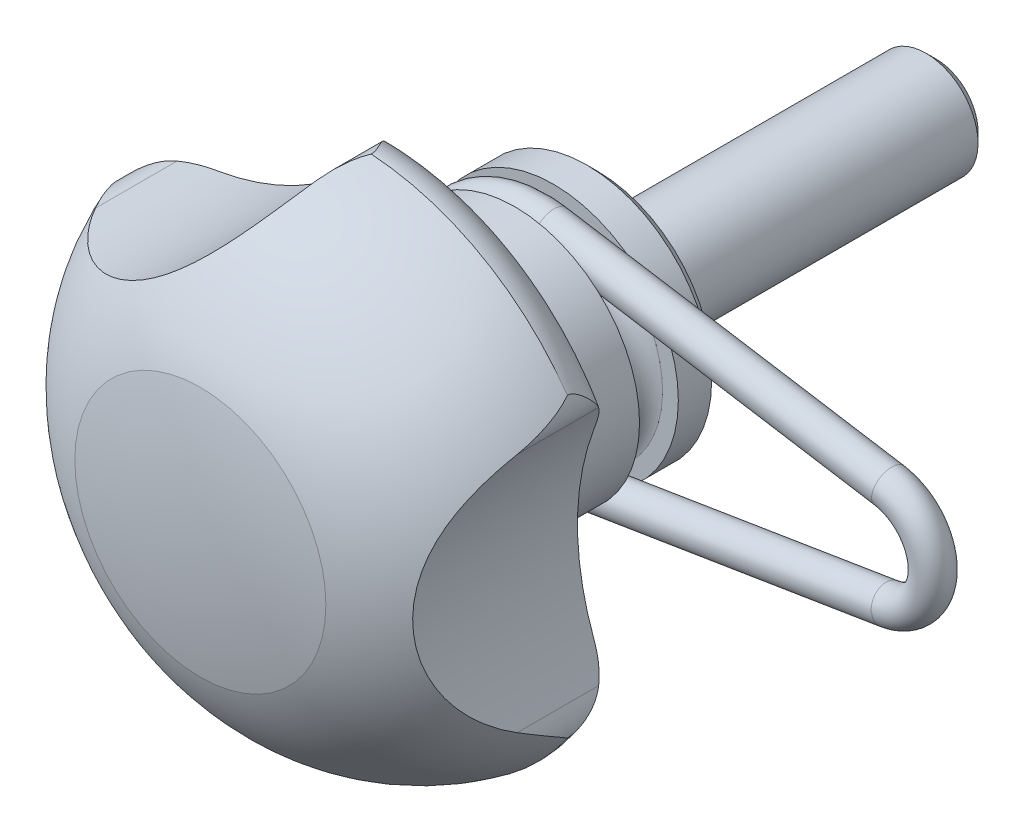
ISO-10303-21;
HEADER;
FILE_DESCRIPTION(('STEP AP214'),'2;1');
FILE_NAME('part.step','',(''),(''),'','','');
FILE_SCHEMA(('AUTOMOTIVE_DESIGN { 1 0 10303 214 1 1 1 1 }'));
ENDSEC;
DATA;
#1=APPLICATION_CONTEXT('core data for automotive mechanical design processes');
#2=APPLICATION_PROTOCOL_DEFINITION('international standard','automotive_design',2000,#1);
#3=PRODUCT_CONTEXT('',#1,'mechanical');
#4=PRODUCT('Part','Part','',(#3));
#5=PRODUCT_RELATED_PRODUCT_CATEGORY('part','',(#4));
#6=PRODUCT_DEFINITION_FORMATION('','',#4);
#7=PRODUCT_DEFINITION_CONTEXT('part definition',#1,'design');
#8=PRODUCT_DEFINITION('design','',#6,#7);
#9=PRODUCT_DEFINITION_SHAPE('','',#8);
#10=(LENGTH_UNIT() NAMED_UNIT(*) SI_UNIT(.MILLI.,.METRE.));
#11=(NAMED_UNIT(*) PLANE_ANGLE_UNIT() SI_UNIT($,.RADIAN.));
#12=(NAMED_UNIT(*) SI_UNIT($,.STERADIAN.) SOLID_ANGLE_UNIT());
#13=UNCERTAINTY_MEASURE_WITH_UNIT(LENGTH_MEASURE(1.E-05),#10,'distance_accuracy_value','');
#14=(GEOMETRIC_REPRESENTATION_CONTEXT(3) GLOBAL_UNCERTAINTY_ASSIGNED_CONTEXT((#13)) GLOBAL_UNIT_ASSIGNED_CONTEXT((#10,
#11,#12)) REPRESENTATION_CONTEXT('',''));
#15=CARTESIAN_POINT('',(0.,0.,0.));
#16=DIRECTION('',(0.,0.,1.));
#17=DIRECTION('',(1.,0.,0.));
#18=AXIS2_PLACEMENT_3D('',#15,#16,#17);
#19=CARTESIAN_POINT('',(0.,0.,3.33333333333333));
#20=DIRECTION('',(0.,0.,1.));
#21=DIRECTION('',(0.,1.,0.));
#22=AXIS2_PLACEMENT_3D('',#19,#20,#21);
#23=TOROIDAL_SURFACE('',#22,5.43685897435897,0.95352564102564);
#24=CARTESIAN_POINT('',(0.,0.,4.26666666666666));
#25=DIRECTION('',(0.,0.,1.));
#26=DIRECTION('',(0.,1.,0.));
#27=AXIS2_PLACEMENT_3D('',#24,#25,#26);
#28=CIRCLE('',#27,5.24166666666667);
#29=CARTESIAN_POINT('',(0.,5.24166666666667,4.26666666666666));
#30=VERTEX_POINT('',#29);
#31=EDGE_CURVE('E401',#30,#30,#28,.T.);
#32=ORIENTED_EDGE('',*,*,#31,.F.);
#33=EDGE_LOOP('',(#32));
#34=FACE_BOUND('',#33,.T.);
#35=CARTESIAN_POINT('',(0.,0.,2.54236949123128));
#36=DIRECTION('',(0.,0.,-1.));
#37=DIRECTION('',(0.,-1.,0.));
#38=AXIS2_PLACEMENT_3D('',#35,#36,#37);
#39=CIRCLE('',#38,4.90432977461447);
#40=CARTESIAN_POINT('',(0.784701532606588,-4.84114594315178,2.54236949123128));
#41=VERTEX_POINT('',#40);
#42=CARTESIAN_POINT('',(0.784701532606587,4.84114594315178,2.54236949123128));
#43=VERTEX_POINT('',#42);
#44=EDGE_CURVE('E359',#41,#43,#39,.T.);
#45=ORIENTED_EDGE('',*,*,#44,.T.);
#46=CARTESIAN_POINT('',(0.693141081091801,4.85424150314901,4.12372363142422));
#47=CARTESIAN_POINT('',(0.743001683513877,4.84802167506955,4.12431582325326));
#48=CARTESIAN_POINT('',(0.792697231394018,4.8403420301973,4.12445310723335));
#49=CARTESIAN_POINT('',(0.891688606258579,4.82192459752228,4.12368628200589));
#50=CARTESIAN_POINT('',(0.940982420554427,4.81117618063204,4.12277851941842));
#51=CARTESIAN_POINT('',(1.03974031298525,4.78627447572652,4.11975362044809));
#52=CARTESIAN_POINT('',(1.08918751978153,4.77205647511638,4.1176122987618));
#53=CARTESIAN_POINT('',(1.18671654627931,4.73994821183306,4.11164704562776));
#54=CARTESIAN_POINT('',(1.23480039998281,4.72206378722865,4.10782577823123));
#55=CARTESIAN_POINT('',(1.32172833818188,4.68501333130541,4.09839477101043));
#56=CARTESIAN_POINT('',(1.36086605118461,4.66645516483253,4.09314510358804));
#57=CARTESIAN_POINT('',(1.4366670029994,4.62579008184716,4.07988620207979));
#58=CARTESIAN_POINT('',(1.47333803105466,4.60369516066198,4.07188619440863));
#59=CARTESIAN_POINT('',(1.53767991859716,4.55925734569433,4.05323360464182));
#60=CARTESIAN_POINT('',(1.5658758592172,4.53744825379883,4.0431585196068));
#61=CARTESIAN_POINT('',(1.61827547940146,4.49141992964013,4.01895781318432));
#62=CARTESIAN_POINT('',(1.64248681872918,4.46720546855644,4.00484010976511));
#63=CARTESIAN_POINT('',(1.68605179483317,4.41732930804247,3.97158198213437));
#64=CARTESIAN_POINT('',(1.70535968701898,4.39165653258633,3.95239743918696));
#65=CARTESIAN_POINT('',(1.73855619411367,4.34105649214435,3.90897267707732));
#66=CARTESIAN_POINT('',(1.75243933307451,4.31613000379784,3.88472738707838));
#67=CARTESIAN_POINT('',(1.77402704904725,4.27204287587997,3.83534356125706));
#68=CARTESIAN_POINT('',(1.78230220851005,4.25255450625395,3.81073651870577));
#69=CARTESIAN_POINT('',(1.79613226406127,4.21642219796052,3.75883219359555));
#70=CARTESIAN_POINT('',(1.80168668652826,4.19977875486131,3.73153444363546));
#71=CARTESIAN_POINT('',(1.8114640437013,4.16772777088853,3.67081317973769));
#72=CARTESIAN_POINT('',(1.81538503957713,4.15283310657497,3.63707072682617));
#73=CARTESIAN_POINT('',(1.82148034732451,4.12786674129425,3.56769642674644));
#74=CARTESIAN_POINT('',(1.82365373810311,4.11779758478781,3.53206359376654));
#75=CARTESIAN_POINT('',(1.82699426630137,4.10168407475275,3.45475881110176));
#76=CARTESIAN_POINT('',(1.82798434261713,4.09637338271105,3.41292463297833));
#77=CARTESIAN_POINT('',(1.8287322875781,4.09240698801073,3.32892462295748));
#78=CARTESIAN_POINT('',(1.8284897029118,4.09375373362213,3.28675867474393));
#79=CARTESIAN_POINT('',(1.82664760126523,4.10328553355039,3.20130418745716));
#80=CARTESIAN_POINT('',(1.82498759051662,4.1117751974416,3.15805036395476));
#81=CARTESIAN_POINT('',(1.81962792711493,4.13576787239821,3.07362604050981));
#82=CARTESIAN_POINT('',(1.81592718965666,4.15127461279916,3.03245666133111));
#83=CARTESIAN_POINT('',(1.80539978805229,4.1883640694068,2.95439105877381));
#84=CARTESIAN_POINT('',(1.79863815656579,4.20981694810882,2.91742501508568));
#85=CARTESIAN_POINT('',(1.78031979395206,4.25779008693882,2.84831041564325));
#86=CARTESIAN_POINT('',(1.76877411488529,4.28429859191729,2.81615098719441));
#87=CARTESIAN_POINT('',(1.74097302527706,4.33670334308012,2.76167248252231));
#88=CARTESIAN_POINT('',(1.72550105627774,4.36225052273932,2.73862258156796));
#89=CARTESIAN_POINT('',(1.68899681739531,4.41349884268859,2.69772483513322));
#90=CARTESIAN_POINT('',(1.66796974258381,4.43919981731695,2.67987216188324));
#91=CARTESIAN_POINT('',(1.62426180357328,4.48540307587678,2.65117153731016));
#92=CARTESIAN_POINT('',(1.60221722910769,4.50613137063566,2.6396948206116));
#93=CARTESIAN_POINT('',(1.55526174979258,4.54566943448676,2.6196967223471));
#94=CARTESIAN_POINT('',(1.53034852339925,4.56447762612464,2.61117775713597));
#95=CARTESIAN_POINT('',(1.48042417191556,4.59863212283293,2.59697473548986));
#96=CARTESIAN_POINT('',(1.45556256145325,4.61413260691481,2.5911251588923));
#97=CARTESIAN_POINT('',(1.4045423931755,4.64340504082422,2.58089831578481));
#98=CARTESIAN_POINT('',(1.37838277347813,4.65717554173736,2.57652227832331));
#99=CARTESIAN_POINT('',(1.29818958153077,4.69625917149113,2.56498899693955));
#100=CARTESIAN_POINT('',(1.24273615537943,4.71915217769,2.55949822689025));
#101=CARTESIAN_POINT('',(1.14611804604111,4.75379218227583,2.55232326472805));
#102=CARTESIAN_POINT('',(1.10543842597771,4.76685031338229,2.5499981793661));
#103=CARTESIAN_POINT('',(1.02331569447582,4.79057840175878,2.54633971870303));
#104=CARTESIAN_POINT('',(0.981872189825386,4.80124708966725,2.54500686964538));
#105=CARTESIAN_POINT('',(0.899383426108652,4.82014986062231,2.54315625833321));
#106=CARTESIAN_POINT('',(0.858349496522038,4.8284323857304,2.54262119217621));
#107=CARTESIAN_POINT('',(0.775964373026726,4.84289690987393,2.54226229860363));
#108=CARTESIAN_POINT('',(0.734613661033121,4.84908162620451,2.54243754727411));
#109=CARTESIAN_POINT('',(0.693141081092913,4.85424150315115,2.54294303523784));
#110=B_SPLINE_CURVE_WITH_KNOTS('',3,(#46,#47,#48,#49,#50,#51,#52,#53,#54,#55,#56,#57,#58,#59,
#60,#61,#62,#63,#64,#65,#66,#67,#68,#69,#70,#71,#72,#73,#74,#75,#76,#77,#78,#79,#80,#81,#82,#83,
#84,#85,#86,#87,#88,#89,#90,#91,#92,#93,#94,#95,#96,#97,#98,#99,#100,#101,#102,#103,#104,#105,
#106,#107,#108,#109),.UNSPECIFIED.,.F.,.F.,(4,2,2,2,2,2,2,2,2,2,2,2,2,2,2,2,2,2,2,2,2,2,2,2,2,2,
2,2,2,2,2,4),(0.,0.150744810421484,0.302018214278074,0.456363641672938,0.61046518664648,
0.741146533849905,0.871393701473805,0.982113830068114,1.09261856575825,1.20411918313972,
1.31573206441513,1.4127482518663,1.50978132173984,1.62062203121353,1.73152112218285,
1.8575032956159,1.9835318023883,2.11522432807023,2.24698692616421,2.3760726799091,
2.50486186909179,2.6173102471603,2.72965383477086,2.82637943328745,2.9231838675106,
3.01267676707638,3.1022441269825,3.28244425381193,3.41073967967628,3.53910310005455,
3.66463962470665,3.79001291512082),.UNSPECIFIED.);
#111=CARTESIAN_POINT('',(0.784701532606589,4.84114594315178,4.12429717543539));
#112=VERTEX_POINT('',#111);
#113=EDGE_CURVE('E194',#112,#43,#110,.T.);
#114=ORIENTED_EDGE('',*,*,#113,.F.);
#115=CARTESIAN_POINT('',(0.,0.,4.12429717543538));
#116=DIRECTION('',(0.,0.,1.));
#117=DIRECTION('',(0.,1.,0.));
#118=AXIS2_PLACEMENT_3D('',#115,#116,#117);
#119=CIRCLE('',#118,4.90432977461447);
#120=CARTESIAN_POINT('',(0.784701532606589,-4.84114594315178,4.12429717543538));
#121=VERTEX_POINT('',#120);
#122=EDGE_CURVE('E133',#112,#121,#119,.T.);
#123=ORIENTED_EDGE('',*,*,#122,.T.);
#124=CARTESIAN_POINT('',(0.693141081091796,-4.85424150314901,2.54294303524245));
#125=CARTESIAN_POINT('',(0.743001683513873,-4.84802167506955,2.54235084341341));
#126=CARTESIAN_POINT('',(0.792697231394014,-4.8403420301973,2.54221355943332));
#127=CARTESIAN_POINT('',(0.891688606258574,-4.82192459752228,2.54298038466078));
#128=CARTESIAN_POINT('',(0.940982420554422,-4.81117618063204,2.54388814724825));
#129=CARTESIAN_POINT('',(1.03974031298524,-4.78627447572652,2.54691304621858));
#130=CARTESIAN_POINT('',(1.08918751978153,-4.77205647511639,2.54905436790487));
#131=CARTESIAN_POINT('',(1.18671654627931,-4.73994821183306,2.55501962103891));
#132=CARTESIAN_POINT('',(1.23480039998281,-4.72206378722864,2.55884088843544));
#133=CARTESIAN_POINT('',(1.32172833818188,-4.6850133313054,2.56827189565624));
#134=CARTESIAN_POINT('',(1.36086605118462,-4.66645516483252,2.57352156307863));
#135=CARTESIAN_POINT('',(1.4366670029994,-4.62579008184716,2.58678046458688));
#136=CARTESIAN_POINT('',(1.47333803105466,-4.60369516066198,2.59478047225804));
#137=CARTESIAN_POINT('',(1.53767991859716,-4.55925734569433,2.61343306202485));
#138=CARTESIAN_POINT('',(1.56587585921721,-4.53744825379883,2.62350814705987));
#139=CARTESIAN_POINT('',(1.61827547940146,-4.49141992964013,2.64770885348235));
#140=CARTESIAN_POINT('',(1.64248681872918,-4.46720546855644,2.66182655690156));
#141=CARTESIAN_POINT('',(1.68605179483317,-4.41732930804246,2.69508468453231));
#142=CARTESIAN_POINT('',(1.70535968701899,-4.39165653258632,2.71426922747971));
#143=CARTESIAN_POINT('',(1.73855619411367,-4.34105649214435,2.75769398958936));
#144=CARTESIAN_POINT('',(1.75243933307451,-4.31613000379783,2.7819392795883));
#145=CARTESIAN_POINT('',(1.77402704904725,-4.27204287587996,2.83132310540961));
#146=CARTESIAN_POINT('',(1.78230220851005,-4.25255450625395,2.8559301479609));
#147=CARTESIAN_POINT('',(1.79613226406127,-4.21642219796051,2.90783447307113));
#148=CARTESIAN_POINT('',(1.80168668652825,-4.1997787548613,2.93513222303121));
#149=CARTESIAN_POINT('',(1.81146404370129,-4.16772777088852,2.99585348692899));
#150=CARTESIAN_POINT('',(1.81538503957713,-4.15283310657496,3.02959593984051));
#151=CARTESIAN_POINT('',(1.82148034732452,-4.12786674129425,3.09897023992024));
#152=CARTESIAN_POINT('',(1.82365373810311,-4.11779758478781,3.13460307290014));
#153=CARTESIAN_POINT('',(1.82699426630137,-4.10168407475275,3.21190785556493));
#154=CARTESIAN_POINT('',(1.82798434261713,-4.09637338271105,3.25374203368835));
#155=CARTESIAN_POINT('',(1.82873228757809,-4.09240698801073,3.3377420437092));
#156=CARTESIAN_POINT('',(1.8284897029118,-4.09375373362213,3.37990799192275));
#157=CARTESIAN_POINT('',(1.82664760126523,-4.10328553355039,3.46536247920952));
#158=CARTESIAN_POINT('',(1.82498759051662,-4.1117751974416,3.50861630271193));
#159=CARTESIAN_POINT('',(1.81962792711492,-4.13576787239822,3.59304062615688));
#160=CARTESIAN_POINT('',(1.81592718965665,-4.15127461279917,3.63421000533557));
#161=CARTESIAN_POINT('',(1.80539978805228,-4.18836406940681,3.71227560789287));
#162=CARTESIAN_POINT('',(1.79863815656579,-4.20981694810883,3.749241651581));
#163=CARTESIAN_POINT('',(1.78031979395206,-4.25779008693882,3.81835625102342));
#164=CARTESIAN_POINT('',(1.76877411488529,-4.2842985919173,3.85051567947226));
#165=CARTESIAN_POINT('',(1.74097302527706,-4.33670334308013,3.90499418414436));
#166=CARTESIAN_POINT('',(1.72550105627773,-4.36225052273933,3.92804408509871));
#167=CARTESIAN_POINT('',(1.6889968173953,-4.4134988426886,3.96894183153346));
#168=CARTESIAN_POINT('',(1.66796974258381,-4.43919981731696,3.98679450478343));
#169=CARTESIAN_POINT('',(1.62426180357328,-4.48540307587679,4.01549512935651));
#170=CARTESIAN_POINT('',(1.60221722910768,-4.50613137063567,4.02697184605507));
#171=CARTESIAN_POINT('',(1.55526174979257,-4.54566943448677,4.04696994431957));
#172=CARTESIAN_POINT('',(1.53034852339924,-4.56447762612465,4.0554889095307));
#173=CARTESIAN_POINT('',(1.48042417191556,-4.59863212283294,4.06969193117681));
#174=CARTESIAN_POINT('',(1.45556256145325,-4.61413260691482,4.07554150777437));
#175=CARTESIAN_POINT('',(1.4045423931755,-4.64340504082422,4.08576835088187));
#176=CARTESIAN_POINT('',(1.37838277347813,-4.65717554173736,4.09014438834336));
#177=CARTESIAN_POINT('',(1.29818958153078,-4.69625917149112,4.10167766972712));
#178=CARTESIAN_POINT('',(1.24273615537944,-4.71915217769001,4.10716843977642));
#179=CARTESIAN_POINT('',(1.14611804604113,-4.75379218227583,4.11434340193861));
#180=CARTESIAN_POINT('',(1.10543842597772,-4.76685031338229,4.11666848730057));
#181=CARTESIAN_POINT('',(1.02331569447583,-4.79057840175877,4.12032694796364));
#182=CARTESIAN_POINT('',(0.981872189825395,-4.80124708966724,4.12165979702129));
#183=CARTESIAN_POINT('',(0.899383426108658,-4.8201498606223,4.12351040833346));
#184=CARTESIAN_POINT('',(0.858349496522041,-4.8284323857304,4.12404547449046));
#185=CARTESIAN_POINT('',(0.775964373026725,-4.84289690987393,4.12440436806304));
#186=CARTESIAN_POINT('',(0.734613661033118,-4.84908162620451,4.12422911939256));
#187=CARTESIAN_POINT('',(0.693141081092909,-4.85424150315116,4.12372363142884));
#188=B_SPLINE_CURVE_WITH_KNOTS('',3,(#124,#125,#126,#127,#128,#129,#130,#131,#132,#133,#134,
#135,#136,#137,#138,#139,#140,#141,#142,#143,#144,#145,#146,#147,#148,#149,#150,#151,#152,#153,
#154,#155,#156,#157,#158,#159,#160,#161,#162,#163,#164,#165,#166,#167,#168,#169,#170,#171,#172,
#173,#174,#175,#176,#177,#178,#179,#180,#181,#182,#183,#184,#185,#186,#187),.UNSPECIFIED.,.F.,
.F.,(4,2,2,2,2,2,2,2,2,2,2,2,2,2,2,2,2,2,2,2,2,2,2,2,2,2,2,2,2,2,2,4),(0.,0.150744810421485,
0.302018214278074,0.456363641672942,0.610465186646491,0.741146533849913,0.871393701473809,
0.98211383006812,1.09261856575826,1.20411918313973,1.31573206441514,1.41274825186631,
1.50978132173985,1.62062203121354,1.73152112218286,1.85750329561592,1.98353180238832,
2.11522432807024,2.24698692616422,2.37607267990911,2.5048618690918,2.61731024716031,
2.72965383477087,2.82637943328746,2.92318386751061,3.01267676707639,3.1022441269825,
3.28244425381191,3.41073967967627,3.53910310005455,3.66463962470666,3.79001291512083),.UNSPECIFIED.);
#189=EDGE_CURVE('E129',#41,#121,#188,.T.);
#190=ORIENTED_EDGE('',*,*,#189,.F.);
#191=EDGE_LOOP('',(#45,#114,#123,#190));
#192=FACE_BOUND('',#191,.T.);
#193=CARTESIAN_POINT('',(0.,0.,2.4));
#194=DIRECTION('',(0.,0.,1.));
#195=DIRECTION('',(0.,1.,0.));
#196=AXIS2_PLACEMENT_3D('',#193,#194,#195);
#197=CIRCLE('',#196,5.24166666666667);
#198=CARTESIAN_POINT('',(0.,5.24166666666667,2.4));
#199=VERTEX_POINT('',#198);
#200=EDGE_CURVE('E404',#199,#199,#197,.T.);
#201=ORIENTED_EDGE('',*,*,#200,.T.);
#202=EDGE_LOOP('',(#201));
#203=FACE_BOUND('',#202,.T.);
#204=ADVANCED_FACE('F14',(#34,#192,#203),#23,.F.);
#205=CARTESIAN_POINT('',(0.,0.,12.));
#206=DIRECTION('',(0.,0.,1.));
#207=DIRECTION('',(0.,1.,0.));
#208=AXIS2_PLACEMENT_3D('',#205,#206,#207);
#209=TOROIDAL_SURFACE('',#208,10.5,2.);
#210=CARTESIAN_POINT('',(0.,0.,10.));
#211=DIRECTION('',(0.,0.,1.));
#212=DIRECTION('',(0.,1.,0.));
#213=AXIS2_PLACEMENT_3D('',#210,#211,#212);
#214=CIRCLE('',#213,10.5);
#215=CARTESIAN_POINT('',(9.54264705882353,4.38039805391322,10.));
#216=VERTEX_POINT('',#215);
#217=CARTESIAN_POINT('',(-0.977787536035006,10.4543737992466,10.));
#218=VERTEX_POINT('',#217);
#219=EDGE_CURVE('E389',#216,#218,#214,.T.);
#220=ORIENTED_EDGE('',*,*,#219,.T.);
#221=CARTESIAN_POINT('',(-10.1034328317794,5.91392586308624,10.4052748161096));
#222=CARTESIAN_POINT('',(-10.0426477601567,5.91645967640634,10.366533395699));
#223=CARTESIAN_POINT('',(-9.98004494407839,5.91952367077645,10.3307983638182));
#224=CARTESIAN_POINT('',(-9.85198799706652,5.92680099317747,10.2652593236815));
#225=CARTESIAN_POINT('',(-9.78653844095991,5.93101253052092,10.2354461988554));
#226=CARTESIAN_POINT('',(-9.58826012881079,5.94540948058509,10.1551927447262));
#227=CARTESIAN_POINT('',(-9.45213994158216,5.95740892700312,10.1130972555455));
#228=CARTESIAN_POINT('',(-9.13357319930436,5.99100868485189,10.0395648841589));
#229=CARTESIAN_POINT('',(-8.94970847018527,6.01442400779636,10.0153429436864));
#230=CARTESIAN_POINT('',(-8.58146480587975,6.06979631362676,9.99536562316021));
#231=CARTESIAN_POINT('',(-8.39708626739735,6.10178228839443,9.99970806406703));
#232=CARTESIAN_POINT('',(-8.06120890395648,6.16778523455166,10.0281329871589));
#233=CARTESIAN_POINT('',(-7.90916869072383,6.20065874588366,10.0489464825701));
#234=CARTESIAN_POINT('',(-7.60846043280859,6.27149554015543,10.1028336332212));
#235=CARTESIAN_POINT('',(-7.45979435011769,6.309461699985,10.1359142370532));
#236=CARTESIAN_POINT('',(-7.16463270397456,6.39056506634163,10.2116376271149));
#237=CARTESIAN_POINT('',(-7.01817672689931,6.43375271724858,10.2543778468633));
#238=CARTESIAN_POINT('',(-6.72891762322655,6.52476088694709,10.3461936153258));
#239=CARTESIAN_POINT('',(-6.58611175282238,6.57257778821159,10.3952642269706));
#240=CARTESIAN_POINT('',(-6.27723620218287,6.68217801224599,10.5061791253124));
#241=CARTESIAN_POINT('',(-6.11175182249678,6.74490839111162,10.568706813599));
#242=CARTESIAN_POINT('',(-5.86510854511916,6.84443723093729,10.6615612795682));
#243=CARTESIAN_POINT('',(-5.78305278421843,6.8785667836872,10.6923959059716));
#244=CARTESIAN_POINT('',(-5.61926690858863,6.94875763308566,10.7526904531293));
#245=CARTESIAN_POINT('',(-5.53753675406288,6.9848186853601,10.7821505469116));
#246=CARTESIAN_POINT('',(-5.37636451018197,7.05802154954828,10.8376626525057));
#247=CARTESIAN_POINT('',(-5.29692148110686,7.0951061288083,10.8637862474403));
#248=CARTESIAN_POINT('',(-5.1378338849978,7.17144195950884,10.9120735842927));
#249=CARTESIAN_POINT('',(-5.05818930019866,7.21069340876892,10.9342369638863));
#250=CARTESIAN_POINT('',(-4.89902692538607,7.29128270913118,10.9727526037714));
#251=CARTESIAN_POINT('',(-4.819510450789,7.33260930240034,10.9891330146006));
#252=CARTESIAN_POINT('',(-4.66047954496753,7.41747651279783,11.0144514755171));
#253=CARTESIAN_POINT('',(-4.58096514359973,7.46101572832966,11.0233941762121));
#254=CARTESIAN_POINT('',(-4.44740934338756,7.53605938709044,11.0312069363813));
#255=CARTESIAN_POINT('',(-4.39320799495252,7.56705072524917,11.0323578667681));
#256=CARTESIAN_POINT('',(-4.28532455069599,7.62981316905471,11.0305515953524));
#257=CARTESIAN_POINT('',(-4.23164249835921,7.66158433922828,11.0275940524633));
#258=CARTESIAN_POINT('',(-4.07153967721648,7.75796272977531,11.0127794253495));
#259=CARTESIAN_POINT('',(-3.96623304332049,7.82353880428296,10.9949710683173));
#260=CARTESIAN_POINT('',(-3.75731549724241,7.95790955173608,10.9469793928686));
#261=CARTESIAN_POINT('',(-3.65379773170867,8.02674351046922,10.916523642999));
#262=CARTESIAN_POINT('',(-3.45059298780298,8.16619136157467,10.8481740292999));
#263=CARTESIAN_POINT('',(-3.35090594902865,8.23680522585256,10.8102802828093));
#264=CARTESIAN_POINT('',(-3.1568779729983,8.37850741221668,10.7317321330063));
#265=CARTESIAN_POINT('',(-3.06246678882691,8.4495473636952,10.691161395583));
#266=CARTESIAN_POINT('',(-2.87593862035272,8.59406607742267,10.6090567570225));
#267=CARTESIAN_POINT('',(-2.7838220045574,8.66754522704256,10.5675227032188));
#268=CARTESIAN_POINT('',(-2.60134159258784,8.81738110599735,10.4853968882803));
#269=CARTESIAN_POINT('',(-2.51097971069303,8.89374073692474,10.4448061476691));
#270=CARTESIAN_POINT('',(-2.33181800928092,9.04957896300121,10.3662303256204));
#271=CARTESIAN_POINT('',(-2.24301815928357,9.1290574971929,10.3282451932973));
#272=CARTESIAN_POINT('',(-2.06838167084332,9.28996613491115,10.2569868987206));
#273=CARTESIAN_POINT('',(-1.9825203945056,9.37133704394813,10.2236424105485));
#274=CARTESIAN_POINT('',(-1.81219068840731,9.53745542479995,10.1622830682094));
#275=CARTESIAN_POINT('',(-1.72772251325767,9.62220350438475,10.1342691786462));
#276=CARTESIAN_POINT('',(-1.47698673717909,9.88123073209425,10.0605066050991));
#277=CARTESIAN_POINT('',(-1.31277053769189,10.0608590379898,10.0247652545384));
#278=CARTESIAN_POINT('',(-1.10175585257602,10.3058737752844,10.0038726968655));
#279=CARTESIAN_POINT('',(-1.05073671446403,10.3662656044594,10.0008531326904));
#280=CARTESIAN_POINT('',(-0.949821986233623,10.4880426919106,9.99945880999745));
#281=CARTESIAN_POINT('',(-0.899926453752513,10.5494280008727,10.0010842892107));
#282=CARTESIAN_POINT('',(-0.751809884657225,10.7352363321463,10.0137077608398));
#283=CARTESIAN_POINT('',(-0.655560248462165,10.8608457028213,10.0325000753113));
#284=CARTESIAN_POINT('',(-0.46950485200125,11.1132753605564,10.095267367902));
#285=CARTESIAN_POINT('',(-0.379784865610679,11.2400931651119,10.1395264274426));
#286=CARTESIAN_POINT('',(-0.253501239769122,11.4253858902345,10.2271121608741));
#287=CARTESIAN_POINT('',(-0.212853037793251,11.4862261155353,10.2597650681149));
#288=CARTESIAN_POINT('',(-0.134618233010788,11.6054708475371,10.3323233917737));
#289=CARTESIAN_POINT('',(-0.0970287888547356,11.66387758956,10.3722219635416));
#290=CARTESIAN_POINT('',(-0.040750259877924,11.752842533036,10.4405428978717));
#291=CARTESIAN_POINT('',(-0.0208904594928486,11.7845659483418,10.4665123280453));
#292=CARTESIAN_POINT('',(0.0176544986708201,11.8467265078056,10.520798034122));
#293=CARTESIAN_POINT('',(0.036339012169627,11.8771629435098,10.5491155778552));
#294=CARTESIAN_POINT('',(0.0543998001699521,11.9068548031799,10.5785887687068));
#295=B_SPLINE_CURVE_WITH_KNOTS('',3,(#221,#222,#223,#224,#225,#226,#227,#228,#229,#230,#231,
#232,#233,#234,#235,#236,#237,#238,#239,#240,#241,#242,#243,#244,#245,#246,#247,#248,#249,#250,
#251,#252,#253,#254,#255,#256,#257,#258,#259,#260,#261,#262,#263,#264,#265,#266,#267,#268,#269,
#270,#271,#272,#273,#274,#275,#276,#277,#278,#279,#280,#281,#282,#283,#284,#285,#286,#287,#288,
#289,#290,#291,#292,#293,#294),.UNSPECIFIED.,.F.,.F.,(4,2,2,2,2,2,2,2,2,2,2,2,2,2,2,2,2,2,2,2,2,
2,2,2,2,2,2,2,2,2,2,2,2,2,2,2,4),(0.,0.216185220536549,0.432035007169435,0.859000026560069,
1.41675409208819,1.97641922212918,2.44655346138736,2.91695441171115,3.39233053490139,
3.86733812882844,4.43024740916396,4.71243376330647,4.99458449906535,5.26895395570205,
5.54334850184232,5.81638830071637,6.08925724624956,6.2764590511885,6.46367639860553,
6.83869468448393,7.22224846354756,7.6057961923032,7.98051168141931,8.35528696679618,
8.73045042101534,9.10560654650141,9.47414195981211,9.84274399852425,10.5773184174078,
10.8145433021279,11.051780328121,11.5280907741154,12.0098204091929,12.2498506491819,
12.4896553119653,12.6262342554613,12.7628874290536),.UNSPECIFIED.);
#296=CARTESIAN_POINT('',(0.0542781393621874,11.9066548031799,10.5783902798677));
#297=VERTEX_POINT('',#296);
#298=EDGE_CURVE('E310',#218,#297,#295,.T.);
#299=ORIENTED_EDGE('',*,*,#298,.T.);
#300=CARTESIAN_POINT('',(0.830100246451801,12.4724068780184,12.0002));
#301=CARTESIAN_POINT('',(0.830145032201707,12.4724102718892,11.9771892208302));
#302=CARTESIAN_POINT('',(0.828818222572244,12.4720989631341,11.9542126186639));
#303=CARTESIAN_POINT('',(0.823740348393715,12.4708654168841,11.9086454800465));
#304=CARTESIAN_POINT('',(0.820000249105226,12.4699459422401,11.8860536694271));
#305=CARTESIAN_POINT('',(0.805785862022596,12.4663419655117,11.8198165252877));
#306=CARTESIAN_POINT('',(0.792295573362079,12.4628104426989,11.7768746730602));
#307=CARTESIAN_POINT('',(0.758574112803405,12.4530967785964,11.6885942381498));
#308=CARTESIAN_POINT('',(0.737757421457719,12.4466621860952,11.6435254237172));
#309=CARTESIAN_POINT('',(0.692870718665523,12.4312138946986,11.5554632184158));
#310=CARTESIAN_POINT('',(0.668795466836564,12.422196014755,11.5124733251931));
#311=CARTESIAN_POINT('',(0.618459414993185,12.4013497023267,11.427183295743));
#312=CARTESIAN_POINT('',(0.592162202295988,12.3894638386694,11.3849191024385));
#313=CARTESIAN_POINT('',(0.538850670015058,12.3629482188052,11.3017205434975));
#314=CARTESIAN_POINT('',(0.511836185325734,12.3483178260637,11.2607864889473));
#315=CARTESIAN_POINT('',(0.445100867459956,12.30875535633,11.1611932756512));
#316=CARTESIAN_POINT('',(0.405342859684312,12.2822044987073,11.1031921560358));
#317=CARTESIAN_POINT('',(0.327175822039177,12.2228526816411,10.989526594));
#318=CARTESIAN_POINT('',(0.288766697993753,12.1900521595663,10.9338619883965));
#319=CARTESIAN_POINT('',(0.215567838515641,12.1190105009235,10.8266156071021));
#320=CARTESIAN_POINT('',(0.180705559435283,12.0809541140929,10.7749623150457));
#321=CARTESIAN_POINT('',(0.114486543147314,11.9984992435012,10.6743867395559));
#322=CARTESIAN_POINT('',(0.0831359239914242,11.9540899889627,10.6254692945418));
#323=CARTESIAN_POINT('',(0.0541565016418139,11.9064548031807,10.5781918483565));
#324=B_SPLINE_CURVE_WITH_KNOTS('',3,(#300,#301,#302,#303,#304,#305,#306,#307,#308,#309,#310,
#311,#312,#313,#314,#315,#316,#317,#318,#319,#320,#321,#322,#323),.UNSPECIFIED.,.F.,.F.,(4,2,2,
2,2,2,2,2,2,2,2,4),(0.,0.0689349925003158,0.137558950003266,0.272350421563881,0.422229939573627,
0.572353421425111,0.725777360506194,0.879236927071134,1.10442488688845,1.3295970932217,
1.54825811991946,1.76729436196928),.UNSPECIFIED.);
#325=CARTESIAN_POINT('',(0.830100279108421,12.4724068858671,12.));
#326=VERTEX_POINT('',#325);
#327=EDGE_CURVE('E302',#326,#297,#324,.T.);
#328=ORIENTED_EDGE('',*,*,#327,.F.);
#329=CARTESIAN_POINT('',(0.,0.,12.));
#330=DIRECTION('',(0.,0.,1.));
#331=DIRECTION('',(0.,1.,0.));
#332=AXIS2_PLACEMENT_3D('',#329,#330,#331);
#333=CIRCLE('',#332,12.5);
#334=CARTESIAN_POINT('',(10.2613005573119,7.13832689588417,12.0000000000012));
#335=VERTEX_POINT('',#334);
#336=EDGE_CURVE('E385',#335,#326,#333,.T.);
#337=ORIENTED_EDGE('',*,*,#336,.F.);
#338=CARTESIAN_POINT('',(10.1731289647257,5.7924889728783,10.4050035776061));
#339=CARTESIAN_POINT('',(10.2010616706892,5.84589763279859,10.4433725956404));
#340=CARTESIAN_POINT('',(10.2255467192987,5.899738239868,10.4835133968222));
#341=CARTESIAN_POINT('',(10.2680505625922,6.00752552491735,10.5667694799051));
#342=CARTESIAN_POINT('',(10.2860802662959,6.06147186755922,10.6098795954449));
#343=CARTESIAN_POINT('',(10.3161308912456,6.16867297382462,10.698452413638));
#344=CARTESIAN_POINT('',(10.3281767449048,6.22192969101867,10.7439044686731));
#345=CARTESIAN_POINT('',(10.3468471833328,6.32746201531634,10.8370308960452));
#346=CARTESIAN_POINT('',(10.3534699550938,6.3797372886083,10.8847060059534));
#347=CARTESIAN_POINT('',(10.361407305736,6.47828778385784,10.9778614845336));
#348=CARTESIAN_POINT('',(10.3631322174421,6.52469033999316,11.0231739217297));
#349=CARTESIAN_POINT('',(10.3628477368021,6.61577969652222,11.1154924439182));
#350=CARTESIAN_POINT('',(10.3608378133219,6.66046625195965,11.1624987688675));
#351=CARTESIAN_POINT('',(10.3535544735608,6.74752101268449,11.2583565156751));
#352=CARTESIAN_POINT('',(10.3482813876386,6.78988945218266,11.3072077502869));
#353=CARTESIAN_POINT('',(10.3351197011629,6.87138577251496,11.4071789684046));
#354=CARTESIAN_POINT('',(10.3272332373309,6.91051626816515,11.458297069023));
#355=CARTESIAN_POINT('',(10.3120831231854,6.97484922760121,11.5509548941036));
#356=CARTESIAN_POINT('',(10.3051351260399,7.00112350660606,11.5917974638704));
#357=CARTESIAN_POINT('',(10.2913134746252,7.04922552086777,11.6760794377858));
#358=CARTESIAN_POINT('',(10.2844397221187,7.07106006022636,11.7195147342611));
#359=CARTESIAN_POINT('',(10.2742597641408,7.10179713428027,11.7960609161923));
#360=CARTESIAN_POINT('',(10.270503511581,7.11261353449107,11.8283164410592));
#361=CARTESIAN_POINT('',(10.2647173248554,7.12898487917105,11.8942399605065));
#362=CARTESIAN_POINT('',(10.2626794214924,7.13456412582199,11.9279006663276));
#363=CARTESIAN_POINT('',(10.2614600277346,7.13788858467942,11.9745662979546));
#364=CARTESIAN_POINT('',(10.2612900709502,7.1383486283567,11.9873824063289));
#365=CARTESIAN_POINT('',(10.2613005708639,7.13832685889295,12.0002000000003));
#366=B_SPLINE_CURVE_WITH_KNOTS('',3,(#338,#339,#340,#341,#342,#343,#344,#345,#346,#347,#348,
#349,#350,#351,#352,#353,#354,#355,#356,#357,#358,#359,#360,#361,#362,#363,#364,#365),
.UNSPECIFIED.,.F.,.F.,(4,2,2,2,2,2,2,2,2,2,2,2,2,4),(0.,0.214133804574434,0.427904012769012,
0.640775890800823,0.853718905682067,1.04820512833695,1.24271901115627,1.43721320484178,
1.63154876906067,1.77858161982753,1.92538740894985,2.02774864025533,2.12963249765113,
2.16807780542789),.UNSPECIFIED.);
#367=CARTESIAN_POINT('',(10.173233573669,5.7926889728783,10.4051472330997));
#368=VERTEX_POINT('',#367);
#369=EDGE_CURVE('E294',#368,#335,#366,.T.);
#370=ORIENTED_EDGE('',*,*,#369,.F.);
#371=CARTESIAN_POINT('',(10.1733381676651,5.7928889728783,10.4052909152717));
#372=CARTESIAN_POINT('',(10.1451403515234,5.73898162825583,10.3665490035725));
#373=CARTESIAN_POINT('',(10.116492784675,5.68323496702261,10.3308134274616));
#374=CARTESIAN_POINT('',(10.0587672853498,5.56869762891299,10.265273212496));
#375=CARTESIAN_POINT('',(10.029690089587,5.50991180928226,10.2354594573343));
#376=CARTESIAN_POINT('',(9.94301987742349,5.33100210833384,10.1552040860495));
#377=CARTESIAN_POINT('',(9.88535205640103,5.20712069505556,10.1131071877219));
#378=CARTESIAN_POINT('',(9.75516823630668,4.91443918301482,10.0395716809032));
#379=CARTESIAN_POINT('',(9.68351488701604,4.74350341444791,10.0153477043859));
#380=CARTESIAN_POINT('',(9.54734778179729,4.3969150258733,9.9953658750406));
#381=CARTESIAN_POINT('',(9.4828593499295,4.22124824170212,9.99970591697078));
#382=CARTESIAN_POINT('',(9.372081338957,3.89737438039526,10.0281262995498));
#383=CARTESIAN_POINT('',(9.32453079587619,3.7492702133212,10.0489375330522));
#384=CARTESIAN_POINT('',(9.23552340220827,3.45343726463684,10.1028200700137));
#385=CARTESIAN_POINT('',(9.19407002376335,3.30570874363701,10.1358983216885));
#386=CARTESIAN_POINT('',(9.1167271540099,3.00954816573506,10.2116164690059));
#387=CARTESIAN_POINT('',(9.08090104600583,2.86112515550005,10.2543536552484));
#388=CARTESIAN_POINT('',(9.01508705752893,2.56512616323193,10.3461634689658));
#389=CARTESIAN_POINT('',(8.98509467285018,2.41754961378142,10.3952311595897));
#390=CARTESIAN_POINT('',(8.92557431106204,2.09527519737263,10.5061375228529));
#391=CARTESIAN_POINT('',(8.89715874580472,1.92061071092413,10.5686594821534));
#392=CARTESIAN_POINT('',(8.86003155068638,1.65726921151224,10.6615069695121));
#393=CARTESIAN_POINT('',(8.84856057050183,1.56914963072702,10.6923395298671));
#394=CARTESIAN_POINT('',(8.82745407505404,1.39222692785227,10.7526308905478));
#395=CARTESIAN_POINT('',(8.8178183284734,1.30342389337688,10.7820898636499));
#396=CARTESIAN_POINT('',(8.80062592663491,1.12725295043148,10.8376031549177));
#397=CARTESIAN_POINT('',(8.79301936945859,1.0399127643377,10.8637288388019));
#398=CARTESIAN_POINT('',(8.77958179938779,0.863974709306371,10.9120216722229));
#399=CARTESIAN_POINT('',(8.77375094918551,0.775376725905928,10.9341884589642));
#400=CARTESIAN_POINT('',(8.76395941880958,0.597247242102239,10.9727124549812));
#401=CARTESIAN_POINT('',(8.75998965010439,0.507722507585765,10.989097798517));
#402=CARTESIAN_POINT('',(8.75396843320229,0.327567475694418,11.0144275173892));
#403=CARTESIAN_POINT('',(8.75191578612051,0.236937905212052,11.0233765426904));
#404=CARTESIAN_POINT('',(8.75012502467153,0.0837581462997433,11.0312004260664));
#405=CARTESIAN_POINT('',(8.74986255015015,0.0213261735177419,11.0323561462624));
#406=CARTESIAN_POINT('',(8.75027242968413,-0.103478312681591,11.030559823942));
#407=CARTESIAN_POINT('',(8.75094486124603,-0.165850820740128,11.0276074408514));
#408=CARTESIAN_POINT('',(8.75435591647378,-0.352684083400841,11.0128083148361));
#409=CARTESIAN_POINT('',(8.75849053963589,-0.476664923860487,10.9950103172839));
#410=CARTESIAN_POINT('',(8.77039354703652,-0.724742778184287,10.9470424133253));
#411=CARTESIAN_POINT('',(8.77824179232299,-0.848779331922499,10.9166024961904));
#412=CARTESIAN_POINT('',(8.79739353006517,-1.09442560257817,10.8482842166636));
#413=CARTESIAN_POINT('',(8.80869697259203,-1.21603535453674,10.8104059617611));
#414=CARTESIAN_POINT('',(8.83438120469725,-1.4548157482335,10.7319019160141));
#415=CARTESIAN_POINT('',(8.84868373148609,-1.57202365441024,10.6913612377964));
#416=CARTESIAN_POINT('',(8.88054361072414,-1.8056711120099,10.6093141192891));
#417=CARTESIAN_POINT('',(8.89810148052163,-1.92211053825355,10.5678075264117));
#418=CARTESIAN_POINT('',(8.93658080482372,-2.15491068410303,10.4857302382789));
#419=CARTESIAN_POINT('',(8.95750570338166,-2.27127119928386,10.4451605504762));
#420=CARTESIAN_POINT('',(9.00283296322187,-2.50418916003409,10.3666222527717));
#421=CARTESIAN_POINT('',(9.02723526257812,-2.62074660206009,10.3286535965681));
#422=CARTESIAN_POINT('',(9.104995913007,-2.96721351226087,10.2220452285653));
#423=CARTESIAN_POINT('',(9.16355289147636,-3.1978439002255,10.159212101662));
#424=CARTESIAN_POINT('',(9.29558857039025,-3.6605176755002,10.060671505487));
#425=CARTESIAN_POINT('',(9.3690204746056,-3.89255447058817,10.0248805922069));
#426=CARTESIAN_POINT('',(9.47688132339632,-4.20125280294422,10.0036879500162));
#427=CARTESIAN_POINT('',(9.50491524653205,-4.27899562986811,10.0006120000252));
#428=CARTESIAN_POINT('',(9.56252384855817,-4.43393094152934,9.99955150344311));
#429=CARTESIAN_POINT('',(9.59209858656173,-4.51112340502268,10.0015671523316));
#430=CARTESIAN_POINT('',(9.68301415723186,-4.74151193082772,10.0161423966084));
#431=CARTESIAN_POINT('',(9.74655161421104,-4.89353420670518,10.0372290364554));
#432=CARTESIAN_POINT('',(9.84134076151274,-5.1086142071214,10.087529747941));
#433=CARTESIAN_POINT('',(9.87126000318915,-5.1748869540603,10.1060040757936));
#434=CARTESIAN_POINT('',(9.93148200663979,-5.30530768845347,10.1488611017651));
#435=CARTESIAN_POINT('',(9.96178458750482,-5.36945663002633,10.1732411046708));
#436=CARTESIAN_POINT('',(10.0226022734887,-5.49549459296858,10.2283938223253));
#437=CARTESIAN_POINT('',(10.0531173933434,-5.55736483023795,10.2592097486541));
#438=CARTESIAN_POINT('',(10.1137016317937,-5.67780440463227,10.3273380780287));
#439=CARTESIAN_POINT('',(10.1437699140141,-5.73636801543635,10.3646613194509));
#440=CARTESIAN_POINT('',(10.1733381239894,-5.79288888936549,10.405290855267));
#441=B_SPLINE_CURVE_WITH_KNOTS('',3,(#371,#372,#373,#374,#375,#376,#377,#378,#379,#380,#381,
#382,#383,#384,#385,#386,#387,#388,#389,#390,#391,#392,#393,#394,#395,#396,#397,#398,#399,#400,
#401,#402,#403,#404,#405,#406,#407,#408,#409,#410,#411,#412,#413,#414,#415,#416,#417,#418,#419,
#420,#421,#422,#423,#424,#425,#426,#427,#428,#429,#430,#431,#432,#433,#434,#435,#436,#437,#438,
#439,#440),.UNSPECIFIED.,.F.,.F.,(4,2,2,2,2,2,2,2,2,2,2,2,2,2,2,2,2,2,2,2,2,2,2,2,2,2,2,2,2,2,2,
2,2,2,4),(0.,0.216183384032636,0.432031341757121,0.858992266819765,1.41673694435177,
1.97639412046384,2.44651795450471,2.91690848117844,3.3922667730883,3.86725657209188,
4.43011977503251,4.71228289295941,4.99441042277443,5.26877690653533,5.543168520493,
5.81620582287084,6.0890722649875,6.27626405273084,6.46347136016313,6.83846874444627,
7.22192473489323,7.60537518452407,7.97984613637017,8.35437665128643,8.72929272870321,
9.10420213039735,9.84131041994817,10.5761348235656,10.8240780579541,11.07203081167,
11.5678886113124,11.7927550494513,12.0175190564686,12.2438436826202,12.4705489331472),.UNSPECIFIED.);
#442=EDGE_CURVE('E474',#368,#216,#441,.T.);
#443=ORIENTED_EDGE('',*,*,#442,.T.);
#444=EDGE_LOOP('',(#220,#299,#328,#337,#370,#443));
#445=FACE_BOUND('',#444,.T.);
#446=ADVANCED_FACE('F187',(#445),#209,.T.);
#447=CARTESIAN_POINT('',(-0.0701278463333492,-11.7064231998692,10.40499648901));
#448=CARTESIAN_POINT('',(-0.0378411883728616,-11.7573183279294,10.4433653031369));
#449=CARTESIAN_POINT('',(-0.00345659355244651,-11.8054436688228,10.483505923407));
#450=CARTESIAN_POINT('',(0.0686376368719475,-11.8961474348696,10.5667616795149));
#451=CARTESIAN_POINT('',(0.106341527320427,-11.9387351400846,10.6098716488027));
#452=CARTESIAN_POINT('',(0.184154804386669,-12.0183609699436,10.6984441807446));
#453=CARTESIAN_POINT('',(0.224253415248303,-12.0554216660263,10.7438960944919));
#454=CARTESIAN_POINT('',(0.306311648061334,-12.1243575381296,10.837022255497));
#455=CARTESIAN_POINT('',(0.348271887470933,-12.1562309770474,10.8846972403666));
#456=CARTESIAN_POINT('',(0.429650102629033,-12.2123806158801,10.9778522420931));
#457=CARTESIAN_POINT('',(0.468973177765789,-12.2370758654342,11.0231643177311));
#458=CARTESIAN_POINT('',(0.548000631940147,-12.2823745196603,11.1154820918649));
#459=CARTESIAN_POINT('',(0.587705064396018,-12.3029773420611,11.1624880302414));
#460=CARTESIAN_POINT('',(0.66673800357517,-12.3401975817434,11.2583449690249));
#461=CARTESIAN_POINT('',(0.706066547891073,-12.3568154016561,11.3071957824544));
#462=CARTESIAN_POINT('',(0.783225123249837,-12.3861656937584,11.4071660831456));
#463=CARTESIAN_POINT('',(0.82105635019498,-12.3989013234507,11.4582836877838));
#464=CARTESIAN_POINT('',(0.884346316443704,-12.4179481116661,11.5509415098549));
#465=CARTESIAN_POINT('',(0.910575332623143,-12.4250684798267,11.5917846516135));
#466=CARTESIAN_POINT('',(0.95914546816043,-12.4371502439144,11.6760677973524));
#467=CARTESIAN_POINT('',(0.981492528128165,-12.4421149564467,11.7195036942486));
#468=CARTESIAN_POINT('',(1.01320311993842,-12.4486677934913,11.7960507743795));
#469=CARTESIAN_POINT('',(1.02444913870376,-12.4508231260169,11.8283065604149));
#470=CARTESIAN_POINT('',(1.04152148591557,-12.4539980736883,11.8942306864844));
#471=CARTESIAN_POINT('',(1.04737284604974,-12.4550229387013,11.9278917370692));
#472=CARTESIAN_POINT('',(1.05086262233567,-12.455629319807,11.97456060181));
#473=CARTESIAN_POINT('',(1.05134622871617,-12.4557121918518,11.9873795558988));
#474=CARTESIAN_POINT('',(1.05132211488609,-12.4557103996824,12.0002000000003));
#475=B_SPLINE_CURVE_WITH_KNOTS('',3,(#447,#448,#449,#450,#451,#452,#453,#454,#455,#456,#457,
#458,#459,#460,#461,#462,#463,#464,#465,#466,#467,#468,#469,#470,#471,#472,#473,#474),
.UNSPECIFIED.,.F.,.F.,(4,2,2,2,2,2,2,2,2,2,2,2,2,4),(0.,0.214133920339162,0.427904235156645,
0.640776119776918,0.853719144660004,1.0482043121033,1.24271713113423,1.43721028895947,
1.63154483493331,1.77858060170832,1.92538933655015,2.02775194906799,2.12963716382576,
2.16809100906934),.UNSPECIFIED.);
#476=CARTESIAN_POINT('',(-0.0700009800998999,-11.7066231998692,10.4051472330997));
#477=VERTEX_POINT('',#476);
#478=CARTESIAN_POINT('',(1.05132215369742,-12.4557104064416,12.0000000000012));
#479=VERTEX_POINT('',#478);
#480=EDGE_CURVE('E376',#477,#479,#475,.T.);
#481=ORIENTED_EDGE('',*,*,#480,.F.);
#482=CARTESIAN_POINT('',(-0.0698740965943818,-11.7068231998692,10.4052980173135));
#483=CARTESIAN_POINT('',(-0.102460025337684,-11.6554498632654,10.3665558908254));
#484=CARTESIAN_POINT('',(-0.136413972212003,-11.6027673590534,10.3308200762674));
#485=CARTESIAN_POINT('',(-0.206742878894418,-11.4955076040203,10.265279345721));
#486=CARTESIAN_POINT('',(-0.243114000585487,-11.4409334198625,10.2354653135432));
#487=CARTESIAN_POINT('',(-0.354718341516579,-11.2764208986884,10.155209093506));
#488=CARTESIAN_POINT('',(-0.433168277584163,-11.1645389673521,10.1131115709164));
#489=CARTESIAN_POINT('',(-0.621544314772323,-10.9054573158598,10.0395746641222));
#490=CARTESIAN_POINT('',(-0.733751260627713,-10.7579367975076,10.0153497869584));
#491=CARTESIAN_POINT('',(-0.965819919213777,-10.4667201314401,9.99536598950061));
#492=CARTESIAN_POINT('',(-1.08570656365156,-10.3230388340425,9.99970497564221));
#493=CARTESIAN_POINT('',(-1.31079806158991,-10.065167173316,10.0281233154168));
#494=CARTESIAN_POINT('',(-1.41528328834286,-9.94993623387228,10.0489334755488));
#495=CARTESIAN_POINT('',(-1.62697546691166,-9.7249391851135,10.1028137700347));
#496=CARTESIAN_POINT('',(-1.73418392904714,-9.61517621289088,10.1358908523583));
#497=CARTESIAN_POINT('',(-1.9519918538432,-9.40011701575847,10.2116065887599));
#498=CARTESIAN_POINT('',(-2.06261516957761,-9.29488019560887,10.2543425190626));
#499=CARTESIAN_POINT('',(-2.28604729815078,-9.08988600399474,10.3461499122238));
#500=CARTESIAN_POINT('',(-2.39885435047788,-8.99012444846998,10.395216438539));
#501=CARTESIAN_POINT('',(-2.64818682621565,-8.77744390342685,10.5061200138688));
#502=CARTESIAN_POINT('',(-2.78523949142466,-8.66550491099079,10.5686403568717));
#503=CARTESIAN_POINT('',(-2.99473083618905,-8.50168378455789,10.6614860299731));
#504=CARTESIAN_POINT('',(-3.06530724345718,-8.4476907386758,10.692318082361));
#505=CARTESIAN_POINT('',(-3.20796962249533,-8.34095241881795,10.7526087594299));
#506=CARTESIAN_POINT('',(-3.28005540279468,-8.28820698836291,10.782067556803));
#507=CARTESIAN_POINT('',(-3.42402377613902,-8.18523404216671,10.8375810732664));
#508=CARTESIAN_POINT('',(-3.49585741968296,-8.13497717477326,10.8637071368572));
#509=CARTESIAN_POINT('',(-3.64150152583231,-8.03537224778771,10.9120013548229));
#510=CARTESIAN_POINT('',(-3.71531216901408,-7.986024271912,10.9341691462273));
#511=CARTESIAN_POINT('',(-3.86467697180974,-7.88848107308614,10.9726959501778));
#512=CARTESIAN_POINT('',(-3.94022073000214,-7.84028136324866,10.9890830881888));
#513=CARTESIAN_POINT('',(-4.09322489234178,-7.74499033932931,11.0144172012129));
#514=CARTESIAN_POINT('',(-4.17068406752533,-7.69789835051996,11.0233688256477));
#515=CARTESIAN_POINT('',(-4.30244053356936,-7.61975966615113,11.0311974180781));
#516=CARTESIAN_POINT('',(-4.35637318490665,-7.5883179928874,11.0323552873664));
#517=CARTESIAN_POINT('',(-4.46465449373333,-7.52627377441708,11.0305637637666));
#518=CARTESIAN_POINT('',(-4.51900318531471,-7.49567129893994,11.0276140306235));
#519=CARTESIAN_POINT('',(-4.68250001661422,-7.40521281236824,11.0128233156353));
#520=CARTESIAN_POINT('',(-4.79193071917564,-7.34680543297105,10.9950315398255));
#521=CARTESIAN_POINT('',(-5.01270898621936,-7.2330793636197,10.9470760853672));
#522=CARTESIAN_POINT('',(-5.12404413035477,-7.17786002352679,10.9166424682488));
#523=CARTESIAN_POINT('',(-5.34634022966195,-7.07162666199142,10.8483358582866));
#524=CARTESIAN_POINT('',(-5.45730118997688,-7.0206125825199,10.8104629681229));
#525=CARTESIAN_POINT('',(-5.67691634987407,-6.92346906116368,10.7319686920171));
#526=CARTESIAN_POINT('',(-5.7855636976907,-6.87725318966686,10.6914324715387));
#527=CARTESIAN_POINT('',(-6.00381987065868,-6.78802404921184,10.6093930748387));
#528=CARTESIAN_POINT('',(-6.11342884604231,-6.74501129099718,10.5678897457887));
#529=CARTESIAN_POINT('',(-6.33425977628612,-6.66193773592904,10.4858176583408));
#530=CARTESIAN_POINT('',(-6.44548327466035,-6.62188002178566,10.4452499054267));
#531=CARTESIAN_POINT('',(-6.6698389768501,-6.54467726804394,10.3667138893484));
#532=CARTESIAN_POINT('',(-6.78297114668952,-6.50753217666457,10.3287455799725));
#533=CARTESIAN_POINT('',(-7.12186992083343,-6.40164195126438,10.2221349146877));
#534=CARTESIAN_POINT('',(-7.35085944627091,-6.33703788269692,10.1592966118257));
#535=CARTESIAN_POINT('',(-7.81752247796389,-6.220043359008,10.0607357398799));
#536=CARTESIAN_POINT('',(-8.05516689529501,-6.1676156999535,10.0249298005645));
#537=CARTESIAN_POINT('',(-8.37642352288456,-6.10666828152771,10.0037071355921));
#538=CARTESIAN_POINT('',(-8.45777341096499,-6.09207116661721,10.0006229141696));
#539=CARTESIAN_POINT('',(-8.62076754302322,-6.06448660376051,9.99954577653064));
#540=CARTESIAN_POINT('',(-8.70241179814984,-6.05149921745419,10.0015530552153));
#541=CARTESIAN_POINT('',(-8.94741154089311,-6.01502956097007,10.0161031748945));
#542=CARTESIAN_POINT('',(-9.11084983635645,-5.99403678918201,10.0371730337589));
#543=CARTESIAN_POINT('',(-9.3445519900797,-5.96857556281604,10.0874545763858));
#544=CARTESIAN_POINT('',(-9.41693226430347,-5.96134560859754,10.1059274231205));
#545=CARTESIAN_POINT('',(-9.5600441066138,-5.9482812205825,10.1487851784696));
#546=CARTESIAN_POINT('',(-9.63077641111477,-5.94244615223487,10.1731673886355));
#547=CARTESIAN_POINT('',(-9.77038979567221,-5.93209096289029,10.2283288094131));
#548=CARTESIAN_POINT('',(-9.83925459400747,-5.92758026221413,10.2591512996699));
#549=CARTESIAN_POINT('',(-9.97390084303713,-5.91982399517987,10.3272972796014));
#550=CARTESIAN_POINT('',(-10.039676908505,-5.91658057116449,10.3646316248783));
#551=CARTESIAN_POINT('',(-10.1034325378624,-5.91392587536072,10.4052746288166));
#552=B_SPLINE_CURVE_WITH_KNOTS('',3,(#482,#483,#484,#485,#486,#487,#488,#489,#490,#491,#492,
#493,#494,#495,#496,#497,#498,#499,#500,#501,#502,#503,#504,#505,#506,#507,#508,#509,#510,#511,
#512,#513,#514,#515,#516,#517,#518,#519,#520,#521,#522,#523,#524,#525,#526,#527,#528,#529,#530,
#531,#532,#533,#534,#535,#536,#537,#538,#539,#540,#541,#542,#543,#544,#545,#546,#547,#548,#549,
#550,#551),.UNSPECIFIED.,.F.,.F.,(4,2,2,2,2,2,2,2,2,2,2,2,2,2,2,2,2,2,2,2,2,2,2,2,2,2,2,2,2,2,2,
2,2,2,4),(0.,0.216182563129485,0.432029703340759,0.858988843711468,1.41672958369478,
1.97638304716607,2.44650105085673,2.91688573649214,3.39223739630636,3.86722059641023,
4.43007135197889,4.71222814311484,4.99434935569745,5.26871056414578,5.54309691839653,
5.8161292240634,6.08899067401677,6.27617034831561,6.46336552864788,6.83833822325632,
7.22176652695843,7.60518953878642,7.97963087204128,8.35413178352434,8.72901800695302,
9.10389756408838,9.84095316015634,10.5757262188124,10.8236891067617,11.0716614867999,
11.5675581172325,11.7925019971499,12.0173433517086,12.2437472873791,12.4705323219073),.UNSPECIFIED.);
#553=CARTESIAN_POINT('',(-0.977787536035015,-10.4543737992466,10.));
#554=VERTEX_POINT('',#553);
#555=EDGE_CURVE('E255',#477,#554,#552,.T.);
#556=ORIENTED_EDGE('',*,*,#555,.T.);
#557=CARTESIAN_POINT('',(9.54264705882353,-4.38039805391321,10.));
#558=VERTEX_POINT('',#557);
#559=EDGE_CURVE('E395',#554,#558,#214,.T.);
#560=ORIENTED_EDGE('',*,*,#559,.T.);
#561=CARTESIAN_POINT('',(10.1732335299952,-5.79268888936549,10.4051471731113));
#562=VERTEX_POINT('',#561);
#563=EDGE_CURVE('E285',#558,#562,#441,.T.);
#564=ORIENTED_EDGE('',*,*,#563,.T.);
#565=CARTESIAN_POINT('',(10.2613005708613,-7.13832685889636,12.0002));
#566=CARTESIAN_POINT('',(10.2612117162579,-7.13849336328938,11.9650466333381));
#567=CARTESIAN_POINT('',(10.2625522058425,-7.1349223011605,11.9302146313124));
#568=CARTESIAN_POINT('',(10.2671957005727,-7.12202988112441,11.8624699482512));
#569=CARTESIAN_POINT('',(10.2704573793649,-7.11282945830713,11.8295324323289));
#570=CARTESIAN_POINT('',(10.2807658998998,-7.08246483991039,11.7431121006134));
#571=CARTESIAN_POINT('',(10.2888695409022,-7.05742813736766,11.6912062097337));
#572=CARTESIAN_POINT('',(10.3053211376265,-7.0007460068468,11.5904786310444));
#573=CARTESIAN_POINT('',(10.3136709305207,-6.96901091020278,11.5417118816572));
#574=CARTESIAN_POINT('',(10.3305774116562,-6.89480784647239,11.4370757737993));
#575=CARTESIAN_POINT('',(10.338831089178,-6.85146950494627,11.3817779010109));
#576=CARTESIAN_POINT('',(10.3520452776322,-6.76122076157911,11.2737255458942));
#577=CARTESIAN_POINT('',(10.357002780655,-6.71430714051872,11.2209734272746));
#578=CARTESIAN_POINT('',(10.3628389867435,-6.61825046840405,11.1178942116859));
#579=CARTESIAN_POINT('',(10.3637425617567,-6.5691228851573,11.0675542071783));
#580=CARTESIAN_POINT('',(10.3609868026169,-6.46908468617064,10.9688716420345));
#581=CARTESIAN_POINT('',(10.3573289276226,-6.41817464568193,10.9205284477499));
#582=CARTESIAN_POINT('',(10.3399631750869,-6.27342534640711,10.7876396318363));
#583=CARTESIAN_POINT('',(10.3205310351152,-6.17806046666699,10.7053228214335));
#584=CARTESIAN_POINT('',(10.2769135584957,-6.03392171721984,10.5878392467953));
#585=CARTESIAN_POINT('',(10.2598562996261,-5.98547977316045,10.5495227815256));
#586=CARTESIAN_POINT('',(10.2205078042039,-5.88874439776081,10.4753294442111));
#587=CARTESIAN_POINT('',(10.1982092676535,-5.84045126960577,10.4394560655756));
#588=CARTESIAN_POINT('',(10.1731289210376,-5.79248888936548,10.4050035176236));
#589=B_SPLINE_CURVE_WITH_KNOTS('',3,(#565,#566,#567,#568,#569,#570,#571,#572,#573,#574,#575,
#576,#577,#578,#579,#580,#581,#582,#583,#584,#585,#586,#587,#588),.UNSPECIFIED.,.F.,.F.,(4,2,2,
2,2,2,2,2,2,2,2,4),(0.,0.104745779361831,0.207316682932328,0.380955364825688,0.557085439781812,
0.769021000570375,0.981149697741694,1.19197513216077,1.40273314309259,1.7833746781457,
1.97537845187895,2.16765124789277),.UNSPECIFIED.);
#590=CARTESIAN_POINT('',(10.2613005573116,-7.13832689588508,12.));
#591=VERTEX_POINT('',#590);
#592=EDGE_CURVE('E275',#591,#562,#589,.T.);
#593=ORIENTED_EDGE('',*,*,#592,.F.);
#594=EDGE_CURVE('E390',#479,#591,#333,.T.);
#595=ORIENTED_EDGE('',*,*,#594,.F.);
#596=EDGE_LOOP('',(#481,#556,#560,#564,#593,#595));
#597=FACE_BOUND('',#596,.T.);
#598=ADVANCED_FACE('F269',(#597),#209,.T.);
#599=CARTESIAN_POINT('',(0.,0.,0.));
#600=DIRECTION('',(0.,0.,1.));
#601=DIRECTION('',(0.,1.,0.));
#602=AXIS2_PLACEMENT_3D('',#599,#600,#601);
#603=PLANE('',#602);
#604=CARTESIAN_POINT('',(0.,0.,0.));
#605=DIRECTION('',(0.,0.,1.));
#606=DIRECTION('',(0.,1.,0.));
#607=AXIS2_PLACEMENT_3D('',#604,#605,#606);
#608=CIRCLE('',#607,4.28571428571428);
#609=CARTESIAN_POINT('',(0.,4.28571428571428,0.));
#610=VERTEX_POINT('',#609);
#611=EDGE_CURVE('E419',#610,#610,#608,.T.);
#612=ORIENTED_EDGE('',*,*,#611,.F.);
#613=EDGE_LOOP('',(#612));
#614=FACE_BOUND('',#613,.T.);
#615=CARTESIAN_POINT('',(0.,0.,0.));
#616=DIRECTION('',(0.,0.,1.));
#617=DIRECTION('',(0.,1.,0.));
#618=AXIS2_PLACEMENT_3D('',#615,#616,#617);
#619=CIRCLE('',#618,2.5);
#620=CARTESIAN_POINT('',(0.,2.5,0.));
#621=VERTEX_POINT('',#620);
#622=EDGE_CURVE('E506',#621,#621,#619,.T.);
#623=ORIENTED_EDGE('',*,*,#622,.T.);
#624=EDGE_LOOP('',(#623));
#625=FACE_BOUND('',#624,.T.);
#626=ADVANCED_FACE('F16',(#614,#625),#603,.F.);
#627=CARTESIAN_POINT('',(0.,0.,20.));
#628=DIRECTION('',(0.,0.,1.));
#629=DIRECTION('',(0.,1.,0.));
#630=AXIS2_PLACEMENT_3D('',#627,#628,#629);
#631=CYLINDRICAL_SURFACE('',#630,4.28571428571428);
#632=CARTESIAN_POINT('',(0.,0.,0.3));
#633=DIRECTION('',(0.,0.,1.));
#634=DIRECTION('',(0.,1.,0.));
#635=AXIS2_PLACEMENT_3D('',#632,#633,#634);
#636=CIRCLE('',#635,4.28571428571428);
#637=CARTESIAN_POINT('',(0.,4.28571428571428,0.3));
#638=VERTEX_POINT('',#637);
#639=EDGE_CURVE('E416',#638,#638,#636,.T.);
#640=ORIENTED_EDGE('',*,*,#639,.F.);
#641=EDGE_LOOP('',(#640));
#642=FACE_BOUND('',#641,.T.);
#643=ORIENTED_EDGE('',*,*,#611,.T.);
#644=EDGE_LOOP('',(#643));
#645=FACE_BOUND('',#644,.T.);
#646=ADVANCED_FACE('F546',(#642,#645),#631,.T.);
#647=CARTESIAN_POINT('',(-4.28571428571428,0.,0.3));
#648=DIRECTION('',(0.,0.,1.));
#649=DIRECTION('',(0.,1.,0.));
#650=AXIS2_PLACEMENT_3D('',#647,#648,#649);
#651=PLANE('',#650);
#652=CARTESIAN_POINT('',(0.,0.,0.3));
#653=DIRECTION('',(0.,0.,1.));
#654=DIRECTION('',(0.,1.,0.));
#655=AXIS2_PLACEMENT_3D('',#652,#653,#654);
#656=CIRCLE('',#655,5.5);
#657=CARTESIAN_POINT('',(0.,5.5,0.3));
#658=VERTEX_POINT('',#657);
#659=EDGE_CURVE('E413',#658,#658,#656,.T.);
#660=ORIENTED_EDGE('',*,*,#659,.F.);
#661=EDGE_LOOP('',(#660));
#662=FACE_BOUND('',#661,.T.);
#663=ORIENTED_EDGE('',*,*,#639,.T.);
#664=EDGE_LOOP('',(#663));
#665=FACE_BOUND('',#664,.T.);
#666=ADVANCED_FACE('F540',(#662,#665),#651,.F.);
#667=CARTESIAN_POINT('',(0.,0.,0.3));
#668=DIRECTION('',(0.,0.,1.));
#669=DIRECTION('',(0.,1.,0.));
#670=AXIS2_PLACEMENT_3D('',#667,#668,#669);
#671=CONICAL_SURFACE('',#670,5.5,0.78539816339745);
#672=CARTESIAN_POINT('',(0.,0.,0.8));
#673=DIRECTION('',(0.,0.,1.));
#674=DIRECTION('',(0.,1.,0.));
#675=AXIS2_PLACEMENT_3D('',#672,#673,#674);
#676=CIRCLE('',#675,6.);
#677=CARTESIAN_POINT('',(0.,6.,0.8));
#678=VERTEX_POINT('',#677);
#679=EDGE_CURVE('E410',#678,#678,#676,.T.);
#680=ORIENTED_EDGE('',*,*,#679,.F.);
#681=EDGE_LOOP('',(#680));
#682=FACE_BOUND('',#681,.T.);
#683=ORIENTED_EDGE('',*,*,#659,.T.);
#684=EDGE_LOOP('',(#683));
#685=FACE_BOUND('',#684,.T.);
#686=ADVANCED_FACE('F535',(#682,#685),#671,.T.);
#687=CARTESIAN_POINT('',(0.,0.,20.));
#688=DIRECTION('',(0.,0.,1.));
#689=DIRECTION('',(0.,1.,0.));
#690=AXIS2_PLACEMENT_3D('',#687,#688,#689);
#691=CYLINDRICAL_SURFACE('',#690,6.);
#692=CARTESIAN_POINT('',(0.,0.,2.4));
#693=DIRECTION('',(0.,0.,1.));
#694=DIRECTION('',(0.,1.,0.));
#695=AXIS2_PLACEMENT_3D('',#692,#693,#694);
#696=CIRCLE('',#695,6.);
#697=CARTESIAN_POINT('',(0.,6.,2.4));
#698=VERTEX_POINT('',#697);
#699=EDGE_CURVE('E407',#698,#698,#696,.T.);
#700=ORIENTED_EDGE('',*,*,#699,.F.);
#701=EDGE_LOOP('',(#700));
#702=FACE_BOUND('',#701,.T.);
#703=ORIENTED_EDGE('',*,*,#679,.T.);
#704=EDGE_LOOP('',(#703));
#705=FACE_BOUND('',#704,.T.);
#706=ADVANCED_FACE('F530',(#702,#705),#691,.T.);
#707=CARTESIAN_POINT('',(-6.,0.,2.4));
#708=DIRECTION('',(0.,0.,-1.));
#709=DIRECTION('',(0.,-1.,0.));
#710=AXIS2_PLACEMENT_3D('',#707,#708,#709);
#711=PLANE('',#710);
#712=ORIENTED_EDGE('',*,*,#200,.F.);
#713=EDGE_LOOP('',(#712));
#714=FACE_BOUND('',#713,.T.);
#715=ORIENTED_EDGE('',*,*,#699,.T.);
#716=EDGE_LOOP('',(#715));
#717=FACE_BOUND('',#716,.T.);
#718=ADVANCED_FACE('F191',(#714,#717),#711,.F.);
#719=CARTESIAN_POINT('',(-5.24166666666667,0.,4.26666666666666));
#720=DIRECTION('',(0.,0.,1.));
#721=DIRECTION('',(0.,1.,0.));
#722=AXIS2_PLACEMENT_3D('',#719,#720,#721);
#723=PLANE('',#722);
#724=CARTESIAN_POINT('',(0.,0.,4.26666666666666));
#725=DIRECTION('',(0.,0.,1.));
#726=DIRECTION('',(0.,1.,0.));
#727=AXIS2_PLACEMENT_3D('',#724,#725,#726);
#728=CIRCLE('',#727,6.);
#729=CARTESIAN_POINT('',(0.,6.,4.26666666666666));
#730=VERTEX_POINT('',#729);
#731=EDGE_CURVE('E398',#730,#730,#728,.T.);
#732=ORIENTED_EDGE('',*,*,#731,.F.);
#733=EDGE_LOOP('',(#732));
#734=FACE_BOUND('',#733,.T.);
#735=ORIENTED_EDGE('',*,*,#31,.T.);
#736=EDGE_LOOP('',(#735));
#737=FACE_BOUND('',#736,.T.);
#738=ADVANCED_FACE('F189',(#734,#737),#723,.F.);
#739=CARTESIAN_POINT('',(0.,0.,20.));
#740=DIRECTION('',(0.,0.,1.));
#741=DIRECTION('',(0.,1.,0.));
#742=AXIS2_PLACEMENT_3D('',#739,#740,#741);
#743=CYLINDRICAL_SURFACE('',#742,6.);
#744=CARTESIAN_POINT('',(0.,0.,10.));
#745=DIRECTION('',(0.,0.,1.));
#746=DIRECTION('',(0.,1.,0.));
#747=AXIS2_PLACEMENT_3D('',#744,#745,#746);
#748=CIRCLE('',#747,6.);
#749=CARTESIAN_POINT('',(0.,6.,10.));
#750=VERTEX_POINT('',#749);
#751=EDGE_CURVE('E394',#750,#750,#748,.T.);
#752=ORIENTED_EDGE('',*,*,#751,.F.);
#753=EDGE_LOOP('',(#752));
#754=FACE_BOUND('',#753,.T.);
#755=ORIENTED_EDGE('',*,*,#731,.T.);
#756=EDGE_LOOP('',(#755));
#757=FACE_BOUND('',#756,.T.);
#758=ADVANCED_FACE('F685',(#754,#757),#743,.T.);
#759=CARTESIAN_POINT('',(-6.,0.,10.));
#760=DIRECTION('',(0.,0.,1.));
#761=DIRECTION('',(0.,1.,0.));
#762=AXIS2_PLACEMENT_3D('',#759,#760,#761);
#763=PLANE('',#762);
#764=CARTESIAN_POINT('',(-8.56485952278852,6.07397574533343,10.));
#765=VERTEX_POINT('',#764);
#766=CARTESIAN_POINT('',(-8.56485952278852,-6.07397574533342,10.));
#767=VERTEX_POINT('',#766);
#768=EDGE_CURVE('E391',#765,#767,#214,.T.);
#769=ORIENTED_EDGE('',*,*,#768,.F.);
#770=CARTESIAN_POINT('',(-10.625,18.4030398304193,10.));
#771=DIRECTION('',(0.,0.,1.));
#772=DIRECTION('',(0.,1.,0.));
#773=AXIS2_PLACEMENT_3D('',#770,#771,#772);
#774=CIRCLE('',#773,12.5);
#775=EDGE_CURVE('E325',#218,#765,#774,.F.);
#776=ORIENTED_EDGE('',*,*,#775,.F.);
#777=ORIENTED_EDGE('',*,*,#219,.F.);
#778=CARTESIAN_POINT('',(21.25,0.,10.));
#779=DIRECTION('',(0.,0.,1.));
#780=DIRECTION('',(0.,1.,0.));
#781=AXIS2_PLACEMENT_3D('',#778,#779,#780);
#782=CIRCLE('',#781,12.5);
#783=EDGE_CURVE('E489',#558,#216,#782,.F.);
#784=ORIENTED_EDGE('',*,*,#783,.F.);
#785=ORIENTED_EDGE('',*,*,#559,.F.);
#786=CARTESIAN_POINT('',(-10.625,-18.4030398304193,10.));
#787=DIRECTION('',(0.,0.,1.));
#788=DIRECTION('',(0.,1.,0.));
#789=AXIS2_PLACEMENT_3D('',#786,#787,#788);
#790=CIRCLE('',#789,12.5);
#791=EDGE_CURVE('E253',#767,#554,#790,.F.);
#792=ORIENTED_EDGE('',*,*,#791,.F.);
#793=EDGE_LOOP('',(#769,#776,#777,#784,#785,#792));
#794=FACE_BOUND('',#793,.T.);
#795=ORIENTED_EDGE('',*,*,#751,.T.);
#796=EDGE_LOOP('',(#795));
#797=FACE_BOUND('',#796,.T.);
#798=ADVANCED_FACE('F267',(#794,#797),#763,.F.);
#799=CARTESIAN_POINT('',(-10.1030328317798,5.91394256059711,10.4050199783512));
#800=CARTESIAN_POINT('',(-10.1632519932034,5.91142774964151,10.443389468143));
#801=CARTESIAN_POINT('',(-10.2221213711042,5.90571127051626,10.4835306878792));
#802=CARTESIAN_POINT('',(-10.3367188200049,5.88862545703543,10.5667875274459));
#803=CARTESIAN_POINT('',(-10.3924520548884,5.87726573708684,10.6098979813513));
#804=CARTESIAN_POINT('',(-10.5003152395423,5.84968842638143,10.6984714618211));
#805=CARTESIAN_POINT('',(-10.5524593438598,5.83349144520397,10.7439238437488));
#806=CARTESIAN_POINT('',(-10.6531872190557,5.79689317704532,10.8370508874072));
#807=CARTESIAN_POINT('',(-10.7017697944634,5.77649048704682,10.8847262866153));
#808=CARTESIAN_POINT('',(-10.7910852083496,5.73408798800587,10.9778828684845));
#809=CARTESIAN_POINT('',(-10.832133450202,5.71237982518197,11.0231961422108));
#810=CARTESIAN_POINT('',(-10.9108767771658,5.66658741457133,11.1155163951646));
#811=CARTESIAN_POINT('',(-10.9485713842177,5.64250282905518,11.1625236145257));
#812=CARTESIAN_POINT('',(-11.0203209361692,5.59266667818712,11.2583832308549));
#813=CARTESIAN_POINT('',(-11.0543762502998,5.56691528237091,11.3072354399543));
#814=CARTESIAN_POINT('',(-11.1183724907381,5.51476790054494,11.4072087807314));
#815=CARTESIAN_POINT('',(-11.1483167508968,5.48837245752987,11.4583280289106));
#816=CARTESIAN_POINT('',(-11.1964532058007,5.4430866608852,11.5509858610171));
#817=CARTESIAN_POINT('',(-11.2157317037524,5.4239336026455,11.5918271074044));
#818=CARTESIAN_POINT('',(-11.2504751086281,5.38791542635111,11.6761063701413));
#819=CARTESIAN_POINT('',(-11.2659458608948,5.37104681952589,11.7195402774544));
#820=CARTESIAN_POINT('',(-11.2874723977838,5.34686477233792,11.7960843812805));
#821=CARTESIAN_POINT('',(-11.2949605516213,5.33820462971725,11.8283393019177));
#822=CARTESIAN_POINT('',(-11.3062434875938,5.32501018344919,11.8942614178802));
#823=CARTESIAN_POINT('',(-11.3100553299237,5.32045682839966,11.927921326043));
#824=CARTESIAN_POINT('',(-11.3123231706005,5.31774039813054,11.9745794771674));
#825=CARTESIAN_POINT('',(-11.3126362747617,5.31736358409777,11.9873890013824));
#826=CARTESIAN_POINT('',(-11.31262268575,5.31738354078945,12.0002000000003));
#827=B_SPLINE_CURVE_WITH_KNOTS('',3,(#799,#800,#801,#802,#803,#804,#805,#806,#807,#808,#809,
#810,#811,#812,#813,#814,#815,#816,#817,#818,#819,#820,#821,#822,#823,#824,#825,#826),
.UNSPECIFIED.,.F.,.F.,(4,2,2,2,2,2,2,2,2,2,2,2,2,4),(0.,0.214133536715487,0.427903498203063,
0.640775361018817,0.853718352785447,1.04820701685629,1.24272336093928,1.43721995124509,
1.63155787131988,1.7785839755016,1.92538294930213,2.02774098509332,2.12962170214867,
2.16804725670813),.UNSPECIFIED.);
#828=CARTESIAN_POINT('',(-10.1032328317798,5.91393421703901,10.4051473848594));
#829=VERTEX_POINT('',#828);
#830=CARTESIAN_POINT('',(-11.3126227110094,5.3173835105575,12.0000000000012));
#831=VERTEX_POINT('',#830);
#832=EDGE_CURVE('E318',#829,#831,#827,.T.);
#833=ORIENTED_EDGE('',*,*,#832,.F.);
#834=EDGE_CURVE('E324',#829,#765,#295,.T.);
#835=ORIENTED_EDGE('',*,*,#834,.T.);
#836=ORIENTED_EDGE('',*,*,#768,.T.);
#837=CARTESIAN_POINT('',(-10.1032325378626,-5.91393422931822,10.4051471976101));
#838=VERTEX_POINT('',#837);
#839=EDGE_CURVE('E244',#767,#838,#552,.T.);
#840=ORIENTED_EDGE('',*,*,#839,.T.);
#841=CARTESIAN_POINT('',(-11.3126226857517,-5.31738354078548,12.0002));
#842=CARTESIAN_POINT('',(-11.3127224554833,-5.31722333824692,11.9650466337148));
#843=CARTESIAN_POINT('',(-11.3103000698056,-5.32016976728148,11.9302146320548));
#844=CARTESIAN_POINT('',(-11.3014566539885,-5.33063736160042,11.8624699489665));
#845=CARTESIAN_POINT('',(-11.295119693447,-5.33806226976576,11.8295324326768));
#846=CARTESIAN_POINT('',(-11.2739774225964,-5.36217201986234,11.7431121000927));
#847=CARTESIAN_POINT('',(-11.2563468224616,-5.3817083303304,11.6912062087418));
#848=CARTESIAN_POINT('',(-11.2154844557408,-5.42429689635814,11.5904786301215));
#849=CARTESIAN_POINT('',(-11.1921759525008,-5.44739557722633,11.541711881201));
#850=CARTESIAN_POINT('',(-11.1363674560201,-5.49913855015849,11.4370757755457));
#851=CARTESIAN_POINT('',(-11.102962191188,-5.52795561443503,11.381777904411));
#852=CARTESIAN_POINT('',(-11.0314115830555,-5.58452380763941,11.2737255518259));
#853=CARTESIAN_POINT('',(-10.9932619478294,-5.61227394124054,11.220973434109));
#854=CARTESIAN_POINT('',(-10.9129925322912,-5.66535658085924,11.1178942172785));
#855=CARTESIAN_POINT('',(-10.8708985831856,-5.69070289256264,11.067554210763));
#856=CARTESIAN_POINT('',(-10.7828850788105,-5.73833543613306,10.9688716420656));
#857=CARTESIAN_POINT('',(-10.7369667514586,-5.76062264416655,10.9205284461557));
#858=CARTESIAN_POINT('',(-10.602930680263,-5.81795666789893,10.7876429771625));
#859=CARTESIAN_POINT('',(-10.5106300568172,-5.8488094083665,10.7053292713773));
#860=CARTESIAN_POINT('',(-10.363999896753,-5.88310453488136,10.5878498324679));
#861=CARTESIAN_POINT('',(-10.3135215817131,-5.89255352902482,10.5495346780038));
#862=CARTESIAN_POINT('',(-10.2100767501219,-5.90684493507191,10.475343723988));
#863=CARTESIAN_POINT('',(-10.1571068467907,-5.91168087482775,10.4394714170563));
#864=CARTESIAN_POINT('',(-10.1030325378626,-5.91394257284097,10.4050197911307));
#865=B_SPLINE_CURVE_WITH_KNOTS('',3,(#841,#842,#843,#844,#845,#846,#847,#848,#849,#850,#851,
#852,#853,#854,#855,#856,#857,#858,#859,#860,#861,#862,#863,#864),.UNSPECIFIED.,.F.,.F.,(4,2,2,
2,2,2,2,2,2,2,2,4),(0.,0.104745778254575,0.207316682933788,0.38095536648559,0.557085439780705,
0.76902099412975,0.981149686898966,1.19197513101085,1.40273314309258,1.78335980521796,
1.97535591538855,2.16762100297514),.UNSPECIFIED.);
#866=CARTESIAN_POINT('',(-11.31262271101,-5.31738351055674,12.));
#867=VERTEX_POINT('',#866);
#868=EDGE_CURVE('E254',#867,#838,#865,.T.);
#869=ORIENTED_EDGE('',*,*,#868,.F.);
#870=EDGE_CURVE('E386',#831,#867,#333,.T.);
#871=ORIENTED_EDGE('',*,*,#870,.F.);
#872=EDGE_LOOP('',(#833,#835,#836,#840,#869,#871));
#873=FACE_BOUND('',#872,.T.);
#874=ADVANCED_FACE('F262',(#873),#209,.T.);
#875=CARTESIAN_POINT('',(0.,0.,9.95553971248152));
#876=DIRECTION('',(0.,0.,1.));
#877=DIRECTION('',(0.,1.,0.));
#878=AXIS2_PLACEMENT_3D('',#875,#876,#877);
#879=DEGENERATE_TOROIDAL_SURFACE('',#878,2.71122162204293,10.,.T.);
#880=CARTESIAN_POINT('',(-11.3127282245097,5.31725722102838,11.9998));
#881=CARTESIAN_POINT('',(-11.2909157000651,5.34332102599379,12.0412432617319));
#882=CARTESIAN_POINT('',(-11.2691899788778,5.36775146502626,12.0836915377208));
#883=CARTESIAN_POINT('',(-11.2257765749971,5.41391260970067,12.1699924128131));
#884=CARTESIAN_POINT('',(-11.2040888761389,5.43564605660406,12.2138435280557));
#885=CARTESIAN_POINT('',(-11.1606213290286,5.47698419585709,12.3023309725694));
#886=CARTESIAN_POINT('',(-11.1388418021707,5.49659361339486,12.3469652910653));
#887=CARTESIAN_POINT('',(-11.0950477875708,5.53404990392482,12.4368696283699));
#888=CARTESIAN_POINT('',(-11.07303323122,5.55189624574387,12.4821398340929));
#889=CARTESIAN_POINT('',(-11.0070530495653,5.60273543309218,12.6175532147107));
#890=CARTESIAN_POINT('',(-10.9626536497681,5.63349260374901,12.7083278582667));
#891=CARTESIAN_POINT('',(-10.8724067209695,5.68993965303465,12.8907967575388));
#892=CARTESIAN_POINT('',(-10.8265581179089,5.71562566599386,12.9824916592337));
#893=CARTESIAN_POINT('',(-10.7275559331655,5.76520501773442,13.1777352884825));
#894=CARTESIAN_POINT('',(-10.6742027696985,5.78847857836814,13.2813405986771));
#895=CARTESIAN_POINT('',(-10.565620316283,5.82927652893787,13.4886464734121));
#896=CARTESIAN_POINT('',(-10.5103916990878,5.84680295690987,13.5923469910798));
#897=CARTESIAN_POINT('',(-10.3974371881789,5.87626420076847,13.8009076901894));
#898=CARTESIAN_POINT('',(-10.3396885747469,5.88812565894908,13.905765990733));
#899=CARTESIAN_POINT('',(-10.2225407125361,5.9057040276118,14.1151345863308));
#900=CARTESIAN_POINT('',(-10.1631407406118,5.91141820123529,14.2196447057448));
#901=CARTESIAN_POINT('',(-10.1030328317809,5.91394256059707,14.3238358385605));
#902=B_SPLINE_CURVE_WITH_KNOTS('',3,(#880,#881,#882,#883,#884,#885,#886,#887,#888,#889,#890,
#891,#892,#893,#894,#895,#896,#897,#898,#899,#900,#901),.UNSPECIFIED.,.F.,.F.,(4,2,2,2,2,2,2,2,
2,2,4),(0.,0.160681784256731,0.321198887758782,0.481351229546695,0.641551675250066,
0.95825949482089,1.27520781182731,1.63155618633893,1.98777805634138,2.34849545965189,
2.70937339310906),.UNSPECIFIED.);
#903=CARTESIAN_POINT('',(-10.1032328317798,5.91393421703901,14.3234890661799));
#904=VERTEX_POINT('',#903);
#905=EDGE_CURVE('E334',#831,#904,#902,.T.);
#906=ORIENTED_EDGE('',*,*,#905,.F.);
#907=ORIENTED_EDGE('',*,*,#870,.T.);
#908=CARTESIAN_POINT('',(-10.1030325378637,-5.91394257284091,14.3238363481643));
#909=CARTESIAN_POINT('',(-10.1514924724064,-5.91191563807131,14.2398253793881));
#910=CARTESIAN_POINT('',(-10.1994981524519,-5.90780503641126,14.1556088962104));
#911=CARTESIAN_POINT('',(-10.2944810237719,-5.89555104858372,13.9868892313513));
#912=CARTESIAN_POINT('',(-10.3414582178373,-5.88740767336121,13.9023860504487));
#913=CARTESIAN_POINT('',(-10.4344766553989,-5.86717651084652,13.7328299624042));
#914=CARTESIAN_POINT('',(-10.4805126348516,-5.85507085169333,13.6477763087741));
#915=CARTESIAN_POINT('',(-10.5713446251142,-5.82699056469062,13.4776482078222));
#916=CARTESIAN_POINT('',(-10.6161406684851,-5.81101603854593,13.3925737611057));
#917=CARTESIAN_POINT('',(-10.7032547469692,-5.77566979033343,13.2248750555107));
#918=CARTESIAN_POINT('',(-10.745607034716,-5.75640164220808,13.1422467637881));
#919=CARTESIAN_POINT('',(-10.8290981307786,-5.71407124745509,12.977350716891));
#920=CARTESIAN_POINT('',(-10.8702369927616,-5.69100916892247,12.895082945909));
#921=CARTESIAN_POINT('',(-10.9512910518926,-5.6408429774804,12.7313859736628));
#922=CARTESIAN_POINT('',(-10.9912084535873,-5.61374673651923,12.6499554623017));
#923=CARTESIAN_POINT('',(-11.0700550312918,-5.55489726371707,12.4883226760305));
#924=CARTESIAN_POINT('',(-11.1089845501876,-5.52314567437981,12.4081199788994));
#925=CARTESIAN_POINT('',(-11.1751981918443,-5.46364866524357,12.2725516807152));
#926=CARTESIAN_POINT('',(-11.2026333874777,-5.4373482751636,12.2166334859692));
#927=CARTESIAN_POINT('',(-11.2437959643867,-5.39490857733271,12.1340995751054));
#928=CARTESIAN_POINT('',(-11.2575500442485,-5.38022665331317,12.1067509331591));
#929=CARTESIAN_POINT('',(-11.2850983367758,-5.34967780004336,12.0527222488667));
#930=CARTESIAN_POINT('',(-11.2988925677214,-5.33381020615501,12.0260425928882));
#931=CARTESIAN_POINT('',(-11.3127282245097,-5.31725722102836,11.9998));
#932=B_SPLINE_CURVE_WITH_KNOTS('',3,(#908,#909,#910,#911,#912,#913,#914,#915,#916,#917,#918,
#919,#920,#921,#922,#923,#924,#925,#926,#927,#928,#929,#930,#931),.UNSPECIFIED.,.F.,.F.,(4,2,2,
2,2,2,2,2,2,2,2,4),(0.,0.290988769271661,0.581976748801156,0.874295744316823,1.16660705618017,
1.45101195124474,1.73540424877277,2.0192487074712,2.30299325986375,2.50571445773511,
2.60754373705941,2.70943053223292),.UNSPECIFIED.);
#933=CARTESIAN_POINT('',(-10.1032325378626,-5.91393422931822,14.3234895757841));
#934=VERTEX_POINT('',#933);
#935=EDGE_CURVE('E340',#934,#867,#932,.T.);
#936=ORIENTED_EDGE('',*,*,#935,.F.);
#937=CARTESIAN_POINT('',(-10.1034325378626,-5.91392587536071,14.3231427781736));
#938=CARTESIAN_POINT('',(-10.005944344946,-5.91801049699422,14.4922306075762));
#939=CARTESIAN_POINT('',(-9.90233502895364,-5.92346801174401,14.65780613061));
#940=CARTESIAN_POINT('',(-9.68322515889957,-5.9380803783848,14.9808738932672));
#941=CARTESIAN_POINT('',(-9.56771674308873,-5.94723768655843,15.1383606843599));
#942=CARTESIAN_POINT('',(-9.32468268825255,-5.97025584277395,15.4447304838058));
#943=CARTESIAN_POINT('',(-9.19709969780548,-5.98414004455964,15.593566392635));
#944=CARTESIAN_POINT('',(-8.93110134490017,-6.01761799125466,15.8804976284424));
#945=CARTESIAN_POINT('',(-8.7926881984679,-6.03721057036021,16.0185951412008));
#946=CARTESIAN_POINT('',(-8.50519357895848,-6.08323031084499,16.2834735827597));
#947=CARTESIAN_POINT('',(-8.35606349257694,-6.10969025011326,16.4101962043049));
#948=CARTESIAN_POINT('',(-8.04892217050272,-6.17036576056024,16.650313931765));
#949=CARTESIAN_POINT('',(-7.89091202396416,-6.20458038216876,16.7637106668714));
#950=CARTESIAN_POINT('',(-7.56784708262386,-6.28151718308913,16.9757898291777));
#951=CARTESIAN_POINT('',(-7.40281106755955,-6.32421767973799,17.0745086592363));
#952=CARTESIAN_POINT('',(-7.06701714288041,-6.41883493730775,17.2566010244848));
#953=CARTESIAN_POINT('',(-6.89625987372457,-6.4707506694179,17.3399762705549));
#954=CARTESIAN_POINT('',(-6.56545702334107,-6.5794269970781,17.4842897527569));
#955=CARTESIAN_POINT('',(-6.40572144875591,-6.63541059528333,17.546526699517));
#956=CARTESIAN_POINT('',(-6.08453311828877,-6.75557009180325,17.6571165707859));
#957=CARTESIAN_POINT('',(-5.92308043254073,-6.81974565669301,17.7054700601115));
#958=CARTESIAN_POINT('',(-5.59987916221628,-6.95625182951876,17.7880702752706));
#959=CARTESIAN_POINT('',(-5.43813045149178,-7.02858791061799,17.8223074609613));
#960=CARTESIAN_POINT('',(-5.11594082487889,-7.18109582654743,17.8764954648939));
#961=CARTESIAN_POINT('',(-4.95549986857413,-7.26126741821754,17.8964467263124));
#962=CARTESIAN_POINT('',(-4.64757916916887,-7.4235698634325,17.921186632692));
#963=CARTESIAN_POINT('',(-4.49992916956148,-7.50524357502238,17.9268674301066));
#964=CARTESIAN_POINT('',(-4.20809927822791,-7.67448758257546,17.9256631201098));
#965=CARTESIAN_POINT('',(-4.06391934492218,-7.76205780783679,17.9187781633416));
#966=CARTESIAN_POINT('',(-3.78009612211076,-7.9423731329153,17.8924614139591));
#967=CARTESIAN_POINT('',(-3.64045094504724,-8.03511603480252,17.8730349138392));
#968=CARTESIAN_POINT('',(-3.3665461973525,-8.22499395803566,17.8216887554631));
#969=CARTESIAN_POINT('',(-3.2322866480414,-8.32212899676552,17.7897690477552));
#970=CARTESIAN_POINT('',(-2.97062009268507,-8.51935737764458,17.7137341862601));
#971=CARTESIAN_POINT('',(-2.8431823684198,-8.6194336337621,17.6696803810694));
#972=CARTESIAN_POINT('',(-2.59509018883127,-8.82200620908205,17.5694882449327));
#973=CARTESIAN_POINT('',(-2.4744380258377,-8.92450332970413,17.5133458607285));
#974=CARTESIAN_POINT('',(-2.24059323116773,-9.13071478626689,17.3893333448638));
#975=CARTESIAN_POINT('',(-2.12739568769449,-9.2344282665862,17.3214710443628));
#976=CARTESIAN_POINT('',(-1.90873179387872,-9.44204596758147,17.1743959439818));
#977=CARTESIAN_POINT('',(-1.80326832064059,-9.54595024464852,17.0951789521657));
#978=CARTESIAN_POINT('',(-1.59870101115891,-9.7544787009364,16.9245783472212));
#979=CARTESIAN_POINT('',(-1.49972911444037,-9.85908693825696,16.833017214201));
#980=CARTESIAN_POINT('',(-1.31011933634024,-10.0662104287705,16.6394042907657));
#981=CARTESIAN_POINT('',(-1.21948459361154,-10.1687248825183,16.5373485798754));
#982=CARTESIAN_POINT('',(-1.04645366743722,-10.3706587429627,16.3234432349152));
#983=CARTESIAN_POINT('',(-0.964063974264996,-10.4700756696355,16.2115860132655));
#984=CARTESIAN_POINT('',(-0.807399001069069,-10.6648012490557,15.9789500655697));
#985=CARTESIAN_POINT('',(-0.733126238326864,-10.7601086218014,15.8581685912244));
#986=CARTESIAN_POINT('',(-0.541974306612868,-11.0123297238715,15.5189675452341));
#987=CARTESIAN_POINT('',(-0.432687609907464,-11.1644675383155,15.2925847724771));
#988=CARTESIAN_POINT('',(-0.284936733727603,-11.378753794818,14.9387960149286));
#989=CARTESIAN_POINT('',(-0.238442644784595,-11.4477661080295,14.8186946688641));
#990=CARTESIAN_POINT('',(-0.150472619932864,-11.5809718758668,14.574090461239));
#991=CARTESIAN_POINT('',(-0.108995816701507,-11.6451661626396,14.4495883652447));
#992=CARTESIAN_POINT('',(-0.0698740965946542,-11.7068231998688,14.323079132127));
#993=B_SPLINE_CURVE_WITH_KNOTS('',3,(#937,#938,#939,#940,#941,#942,#943,#944,#945,#946,#947,
#948,#949,#950,#951,#952,#953,#954,#955,#956,#957,#958,#959,#960,#961,#962,#963,#964,#965,#966,
#967,#968,#969,#970,#971,#972,#973,#974,#975,#976,#977,#978,#979,#980,#981,#982,#983,#984,#985,
#986,#987,#988,#989,#990,#991,#992),.UNSPECIFIED.,.F.,.F.,(4,2,2,2,2,2,2,2,2,2,2,2,2,2,2,2,2,2,
2,2,2,2,2,2,2,2,2,4),(0.,0.585597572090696,1.17158456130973,1.76050974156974,2.3493147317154,
2.94098349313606,3.53257984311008,4.12268357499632,4.71272146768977,5.25303493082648,
5.79332640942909,6.33398243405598,6.87462168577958,7.38051137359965,7.88639499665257,
8.39206527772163,8.89773756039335,9.40089872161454,9.90422885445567,10.407223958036,
10.9104052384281,11.4218015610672,11.9333896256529,12.4453772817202,12.9575232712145,
13.8365447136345,14.2746976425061,14.7127747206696),.UNSPECIFIED.);
#994=CARTESIAN_POINT('',(-0.0700009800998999,-11.7066231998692,14.3234894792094));
#995=VERTEX_POINT('',#994);
#996=EDGE_CURVE('E235',#934,#995,#993,.T.);
#997=ORIENTED_EDGE('',*,*,#996,.T.);
#998=CARTESIAN_POINT('',(1.05148428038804,-12.4557386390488,11.9998));
#999=CARTESIAN_POINT('',(1.0180060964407,-12.4498803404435,12.0412432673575));
#1000=CARTESIAN_POINT('',(0.985985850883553,-12.4432805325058,12.0836915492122));
#1001=CARTESIAN_POINT('',(0.924302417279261,-12.428763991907,12.1699924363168));
#1002=CARTESIAN_POINT('',(0.894636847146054,-12.4208486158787,12.213843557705));
#1003=CARTESIAN_POINT('',(0.837103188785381,-12.4038736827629,12.3023310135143));
#1004=CARTESIAN_POINT('',(0.809231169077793,-12.394816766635,12.3469653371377));
#1005=CARTESIAN_POINT('',(0.754896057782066,-12.3756181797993,12.4368696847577));
#1006=CARTESIAN_POINT('',(0.72843339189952,-12.3654761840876,12.4821398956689));
#1007=CARTESIAN_POINT('',(0.651415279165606,-12.3337552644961,12.6175532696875));
#1008=CARTESIAN_POINT('',(0.602579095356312,-12.3106828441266,12.7083279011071));
#1009=CARTESIAN_POINT('',(0.508571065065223,-12.2607502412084,12.8907967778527));
#1010=CARTESIAN_POINT('',(0.463402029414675,-12.2338871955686,12.9824916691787));
#1011=CARTESIAN_POINT('',(0.370961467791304,-12.1729368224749,13.1777405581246));
#1012=CARTESIAN_POINT('',(0.324127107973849,-12.1383665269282,13.2813511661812));
#1013=CARTESIAN_POINT('',(0.23449966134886,-12.0647261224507,13.4886676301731));
#1014=CARTESIAN_POINT('',(0.191705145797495,-12.0256576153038,13.592373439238));
#1015=CARTESIAN_POINT('',(0.109710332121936,-11.9425615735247,13.8009448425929));
#1016=CARTESIAN_POINT('',(0.0705622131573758,-11.8984776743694,13.9058085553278));
#1017=CARTESIAN_POINT('',(-0.00323748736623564,-11.8058076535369,14.1151879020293));
#1018=CARTESIAN_POINT('',(-0.0378870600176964,-11.7572195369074,14.2197033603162));
#1019=CARTESIAN_POINT('',(-0.070127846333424,-11.7064231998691,14.3238997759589));
#1020=B_SPLINE_CURVE_WITH_KNOTS('',3,(#998,#999,#1000,#1001,#1002,#1003,#1004,#1005,#1006,#1007,
#1008,#1009,#1010,#1011,#1012,#1013,#1014,#1015,#1016,#1017,#1018,#1019),.UNSPECIFIED.,.F.,.F.,
(4,2,2,2,2,2,2,2,2,2,4),(0.,0.160681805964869,0.321198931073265,0.481351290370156,
0.641551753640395,0.958259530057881,1.27520781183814,1.63157435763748,1.98781439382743,
2.3485505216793,2.70944719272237),.UNSPECIFIED.);
#1021=EDGE_CURVE('E355',#479,#995,#1020,.T.);
#1022=ORIENTED_EDGE('',*,*,#1021,.F.);
#1023=ORIENTED_EDGE('',*,*,#594,.T.);
#1024=CARTESIAN_POINT('',(10.1731289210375,-5.79248888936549,14.323880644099));
#1025=CARTESIAN_POINT('',(10.195604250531,-5.83546969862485,14.2398696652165));
#1026=CARTESIAN_POINT('',(10.216047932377,-5.87909896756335,14.1556531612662));
#1027=CARTESIAN_POINT('',(10.2529285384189,-5.96748323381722,13.9869334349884));
#1028=CARTESIAN_POINT('',(10.2693654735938,-6.01223822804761,13.9024302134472));
#1029=CARTESIAN_POINT('',(10.2983553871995,-6.1029098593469,13.7328740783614));
#1030=CARTESIAN_POINT('',(10.3108902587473,-6.14883087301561,13.6478204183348));
#1031=CARTESIAN_POINT('',(10.3319893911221,-6.24153355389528,13.4776922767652));
#1032=CARTESIAN_POINT('',(10.3405537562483,-6.28831519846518,13.3926177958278));
#1033=CARTESIAN_POINT('',(10.3535014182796,-6.3814310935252,13.2249189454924));
#1034=CARTESIAN_POINT('',(10.3579915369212,-6.42774322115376,13.1422905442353));
#1035=CARTESIAN_POINT('',(10.3630792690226,-6.52121360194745,12.9773942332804));
#1036=CARTESIAN_POINT('',(10.3636770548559,-6.56837181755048,12.8951263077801));
#1037=CARTESIAN_POINT('',(10.3607603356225,-6.66364950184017,12.7314289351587));
#1038=CARTESIAN_POINT('',(10.3572537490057,-6.71176694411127,12.649998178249));
#1039=CARTESIAN_POINT('',(10.3457134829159,-6.80947439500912,12.488364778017));
#1040=CARTESIAN_POINT('',(10.3376813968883,-6.85906387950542,12.4081617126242));
#1041=CARTESIAN_POINT('',(10.3192629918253,-6.94615879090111,12.2725857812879));
#1042=CARTESIAN_POINT('',(10.3102032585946,-6.98307273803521,12.2166605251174));
#1043=CARTESIAN_POINT('',(10.2940293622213,-7.03994696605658,12.1341162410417));
#1044=CARTESIAN_POINT('',(10.2881909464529,-7.05920154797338,12.1067641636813));
#1045=CARTESIAN_POINT('',(10.2755077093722,-7.09833810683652,12.0527287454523));
#1046=CARTESIAN_POINT('',(10.2686623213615,-7.11822043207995,12.0260457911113));
#1047=CARTESIAN_POINT('',(10.2612439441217,-7.13848141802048,11.9998));
#1048=B_SPLINE_CURVE_WITH_KNOTS('',3,(#1024,#1025,#1026,#1027,#1028,#1029,#1030,#1031,#1032,
#1033,#1034,#1035,#1036,#1037,#1038,#1039,#1040,#1041,#1042,#1043,#1044,#1045,#1046,#1047),
.UNSPECIFIED.,.F.,.F.,(4,2,2,2,2,2,2,2,2,2,2,4),(0.,0.290989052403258,0.581977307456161,
0.874296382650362,1.1666077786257,1.45101290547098,1.73540543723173,2.0192502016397,
2.30299508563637,2.50574082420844,2.60758248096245,2.70948167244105),.UNSPECIFIED.);
#1049=CARTESIAN_POINT('',(10.1732335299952,-5.79268888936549,14.3234896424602));
#1050=VERTEX_POINT('',#1049);
#1051=EDGE_CURVE('E422',#1050,#591,#1048,.T.);
#1052=ORIENTED_EDGE('',*,*,#1051,.F.);
#1053=CARTESIAN_POINT('',(10.1733381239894,-5.79288888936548,14.3230986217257));
#1054=CARTESIAN_POINT('',(10.1281316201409,-5.70642015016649,14.4921874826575));
#1055=CARTESIAN_POINT('',(10.0810534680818,-5.61396389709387,14.657764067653));
#1056=CARTESIAN_POINT('',(9.98415343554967,-5.41690456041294,14.9808340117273));
#1057=CARTESIAN_POINT('',(9.93432975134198,-5.31229344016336,15.1383219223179));
#1058=CARTESIAN_POINT('',(9.83274705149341,-5.09031214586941,15.4446940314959));
#1059=CARTESIAN_POINT('',(9.78097958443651,-4.97288062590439,15.5935311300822));
#1060=CARTESIAN_POINT('',(9.67697297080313,-4.72578163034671,15.8804647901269));
#1061=CARTESIAN_POINT('',(9.62473392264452,-4.59611665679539,16.0185635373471));
#1062=CARTESIAN_POINT('',(9.52084048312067,-4.32413028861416,16.2834444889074));
#1063=CARTESIAN_POINT('',(9.46919017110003,-4.18175040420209,16.4101683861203));
#1064=CARTESIAN_POINT('',(9.36816545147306,-3.88542141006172,16.6502886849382));
#1065=CARTESIAN_POINT('',(9.31879076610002,-3.73147371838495,16.7636867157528));
#1066=CARTESIAN_POINT('',(9.22388675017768,-3.41322358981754,16.9757684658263));
#1067=CARTESIAN_POINT('',(9.1783480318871,-3.24894825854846,17.074488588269));
#1068=CARTESIAN_POINT('',(9.09239109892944,-2.91083402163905,17.2565835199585));
#1069=CARTESIAN_POINT('',(9.05197231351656,-2.73699618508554,17.3399600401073));
#1070=CARTESIAN_POINT('',(8.98068636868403,-2.39617457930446,17.4842759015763));
#1071=CARTESIAN_POINT('',(8.9493013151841,-2.22984779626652,17.5465139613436));
#1072=CARTESIAN_POINT('',(8.892767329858,-1.89161084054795,17.6571060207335));
#1073=CARTESIAN_POINT('',(8.86761814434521,-1.71970089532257,17.7054605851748));
#1074=CARTESIAN_POINT('',(8.8242342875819,-1.3715471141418,17.7880629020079));
#1075=CARTESIAN_POINT('',(8.80600429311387,-1.1953004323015,17.8223011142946));
#1076=CARTESIAN_POINT('',(8.77698416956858,-0.840021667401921,17.8764911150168));
#1077=CARTESIAN_POINT('',(8.76619380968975,-0.660989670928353,17.8964433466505));
#1078=CARTESIAN_POINT('',(8.7527905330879,-0.313171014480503,17.9211850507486));
#1079=CARTESIAN_POINT('',(8.74969657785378,-0.144465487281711,17.9268667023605));
#1080=CARTESIAN_POINT('',(8.75035031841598,0.192888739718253,17.9256640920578));
#1081=CARTESIAN_POINT('',(8.75409793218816,0.36153744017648,17.9187799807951));
#1082=CARTESIAN_POINT('',(8.76834307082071,0.697493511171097,17.8924649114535));
#1083=CARTESIAN_POINT('',(8.7788377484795,0.864801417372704,17.8730392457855));
#1084=CARTESIAN_POINT('',(8.80632362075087,1.19694929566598,17.8216947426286));
#1085=CARTESIAN_POINT('',(8.82331484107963,1.36178925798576,17.7897758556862));
#1086=CARTESIAN_POINT('',(8.86328555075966,1.68701387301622,17.713742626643));
#1087=CARTESIAN_POINT('',(8.88623488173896,1.84741658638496,17.6696896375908));
#1088=CARTESIAN_POINT('',(8.93762105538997,2.16355763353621,17.5694991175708));
#1089=CARTESIAN_POINT('',(8.96605973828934,2.31929438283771,17.5133575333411));
#1090=CARTESIAN_POINT('',(9.02772105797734,2.62491640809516,17.3893465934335));
#1091=CARTESIAN_POINT('',(9.06094049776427,2.77480551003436,17.3214850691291));
#1092=CARTESIAN_POINT('',(9.13141021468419,3.06798373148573,17.1744114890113));
#1093=CARTESIAN_POINT('',(9.16866197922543,3.21127038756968,17.0951952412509));
#1094=CARTESIAN_POINT('',(9.24696880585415,3.49269599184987,16.924596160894));
#1095=CARTESIAN_POINT('',(9.28807603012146,3.63071271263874,16.8330358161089));
#1096=CARTESIAN_POINT('',(9.37264496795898,3.89848224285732,16.6394244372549));
#1097=CARTESIAN_POINT('',(9.41610755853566,4.02823193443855,16.5373694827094));
#1098=CARTESIAN_POINT('',(9.50447169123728,4.27904903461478,16.3234656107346));
#1099=CARTESIAN_POINT('',(9.54937433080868,4.40010958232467,16.2116091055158));
#1100=CARTESIAN_POINT('',(9.63967900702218,4.63314928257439,15.9789745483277));
#1101=CARTESIAN_POINT('',(9.68508119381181,4.7451256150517,15.8581937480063));
#1102=CARTESIAN_POINT('',(9.80793571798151,5.03678160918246,15.5189927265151));
#1103=CARTESIAN_POINT('',(9.88504827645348,5.20749784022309,15.292609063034));
#1104=CARTESIAN_POINT('',(9.99675125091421,5.44260006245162,14.9388186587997));
#1105=CARTESIAN_POINT('',(10.0332709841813,5.51737225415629,14.8187167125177));
#1106=CARTESIAN_POINT('',(10.1046462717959,5.66016125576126,14.57411121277));
#1107=CARTESIAN_POINT('',(10.1395021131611,5.72817923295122,14.4496084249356));
#1108=CARTESIAN_POINT('',(10.1733381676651,5.79288897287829,14.3230984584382));
#1109=B_SPLINE_CURVE_WITH_KNOTS('',3,(#1053,#1054,#1055,#1056,#1057,#1058,#1059,#1060,#1061,
#1062,#1063,#1064,#1065,#1066,#1067,#1068,#1069,#1070,#1071,#1072,#1073,#1074,#1075,#1076,#1077,
#1078,#1079,#1080,#1081,#1082,#1083,#1084,#1085,#1086,#1087,#1088,#1089,#1090,#1091,#1092,#1093,
#1094,#1095,#1096,#1097,#1098,#1099,#1100,#1101,#1102,#1103,#1104,#1105,#1106,#1107,#1108),
.UNSPECIFIED.,.F.,.F.,(4,2,2,2,2,2,2,2,2,2,2,2,2,2,2,2,2,2,2,2,2,2,2,2,2,2,2,4),(0.,
0.585599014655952,1.17158744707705,1.76051412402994,2.34932061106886,2.94099087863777,
3.53258873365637,4.12269395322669,4.71273333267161,5.25304797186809,5.79334062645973,
6.33399782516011,6.87463825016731,7.38052811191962,7.88641190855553,8.39208236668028,
8.89775482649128,9.40091598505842,9.90424611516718,10.4072412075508,10.9104224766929,
11.4218184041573,11.9334060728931,12.445393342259,12.9575389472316,13.8365668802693,
14.2747230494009,14.712803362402),.UNSPECIFIED.);
#1110=CARTESIAN_POINT('',(10.173233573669,5.7926889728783,14.3234894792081));
#1111=VERTEX_POINT('',#1110);
#1112=EDGE_CURVE('E428',#1050,#1111,#1109,.T.);
#1113=ORIENTED_EDGE('',*,*,#1112,.T.);
#1114=CARTESIAN_POINT('',(10.2612439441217,7.13848141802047,11.9998));
#1115=CARTESIAN_POINT('',(10.272909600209,7.10655931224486,12.0412432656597));
#1116=CARTESIAN_POINT('',(10.2832041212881,7.0755290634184,12.0836915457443));
#1117=CARTESIAN_POINT('',(10.3014741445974,7.01485137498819,12.1699924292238));
#1118=CARTESIAN_POINT('',(10.3094520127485,6.98520255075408,12.2138435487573));
#1119=CARTESIAN_POINT('',(10.3235181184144,6.92688947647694,12.3023310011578));
#1120=CARTESIAN_POINT('',(10.3296106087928,6.89822314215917,12.3469653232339));
#1121=CARTESIAN_POINT('',(10.3401517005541,6.84156826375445,12.4368696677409));
#1122=CARTESIAN_POINT('',(10.3445998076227,6.81357992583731,12.4821398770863));
#1123=CARTESIAN_POINT('',(10.3556377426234,6.73101982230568,12.6175532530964));
#1124=CARTESIAN_POINT('',(10.3600745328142,6.67719023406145,12.7083278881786));
#1125=CARTESIAN_POINT('',(10.3638356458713,6.57081058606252,12.8907967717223));
#1126=CARTESIAN_POINT('',(10.363156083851,6.51826152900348,12.9824916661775));
#1127=CARTESIAN_POINT('',(10.3565918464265,6.4077313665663,13.1777389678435));
#1128=CARTESIAN_POINT('',(10.3500704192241,6.34988735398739,13.2813479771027));
#1129=CARTESIAN_POINT('',(10.3311101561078,6.23544922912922,13.4886612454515));
#1130=CARTESIAN_POINT('',(10.3186734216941,6.1788546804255,13.5923654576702));
#1131=CARTESIAN_POINT('',(10.287708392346,6.06629873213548,13.8009336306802));
#1132=CARTESIAN_POINT('',(10.2691051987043,6.0103543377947,13.9057957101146));
#1133=CARTESIAN_POINT('',(10.2257517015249,5.90010848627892,14.1151718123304));
#1134=CARTESIAN_POINT('',(10.200998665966,5.84580777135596,14.2196856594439));
#1135=CARTESIAN_POINT('',(10.1731289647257,5.7924889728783,14.3238804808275));
#1136=B_SPLINE_CURVE_WITH_KNOTS('',3,(#1114,#1115,#1116,#1117,#1118,#1119,#1120,#1121,#1122,
#1123,#1124,#1125,#1126,#1127,#1128,#1129,#1130,#1131,#1132,#1133,#1134,#1135),.UNSPECIFIED.,
.F.,.F.,(4,2,2,2,2,2,2,2,2,2,4),(0.,0.160681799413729,0.321198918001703,0.481351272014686,
0.641551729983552,0.958259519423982,1.27520781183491,1.63156887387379,1.98780342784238,
2.34853390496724,2.70942492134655),.UNSPECIFIED.);
#1137=EDGE_CURVE('E435',#335,#1111,#1136,.T.);
#1138=ORIENTED_EDGE('',*,*,#1137,.F.);
#1139=ORIENTED_EDGE('',*,*,#336,.T.);
#1140=CARTESIAN_POINT('',(0.0541565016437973,11.9064548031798,13.8856060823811));
#1141=CARTESIAN_POINT('',(0.0707612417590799,11.9337557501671,13.8215529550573));
#1142=CARTESIAN_POINT('',(0.0883088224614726,11.9602633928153,13.7574133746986));
#1143=CARTESIAN_POINT('',(0.125216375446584,12.0116783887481,13.6290137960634));
#1144=CARTESIAN_POINT('',(0.144576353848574,12.036585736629,13.5647537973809));
#1145=CARTESIAN_POINT('',(0.20535400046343,12.1089928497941,13.3715889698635));
#1146=CARTESIAN_POINT('',(0.249395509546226,12.1540571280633,13.2425823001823));
#1147=CARTESIAN_POINT('',(0.343476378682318,12.2367856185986,12.987236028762));
#1148=CARTESIAN_POINT('',(0.393393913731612,12.274568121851,12.8608901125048));
#1149=CARTESIAN_POINT('',(0.473868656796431,12.3262061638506,12.6724684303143));
#1150=CARTESIAN_POINT('',(0.501613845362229,12.3425737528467,12.609870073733));
#1151=CARTESIAN_POINT('',(0.559287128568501,12.3735718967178,12.4852567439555));
#1152=CARTESIAN_POINT('',(0.589214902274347,12.3882027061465,12.4232416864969));
#1153=CARTESIAN_POINT('',(0.651872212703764,12.4156638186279,12.2999737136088));
#1154=CARTESIAN_POINT('',(0.684609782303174,12.4284886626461,12.2387235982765));
#1155=CARTESIAN_POINT('',(0.736604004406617,12.4461957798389,12.1480217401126));
#1156=CARTESIAN_POINT('',(0.754457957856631,12.4518535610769,12.1179203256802));
#1157=CARTESIAN_POINT('',(0.791377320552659,12.4625937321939,12.0583381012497));
#1158=CARTESIAN_POINT('',(0.810443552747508,12.4676757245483,12.0288577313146));
#1159=CARTESIAN_POINT('',(0.830236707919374,12.4724396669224,11.9998));
#1160=B_SPLINE_CURVE_WITH_KNOTS('',3,(#1140,#1141,#1142,#1143,#1144,#1145,#1146,#1147,#1148,
#1149,#1150,#1151,#1152,#1153,#1154,#1155,#1156,#1157,#1158,#1159),.UNSPECIFIED.,.F.,.F.,(4,2,2,
2,2,2,2,2,2,4),(0.,0.214720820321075,0.429442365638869,0.85983254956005,1.28249874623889,
1.49365492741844,1.70478012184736,1.91653039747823,2.02286062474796,2.12926382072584),.UNSPECIFIED.);
#1161=CARTESIAN_POINT('',(0.0542781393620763,11.9066548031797,13.8851368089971));
#1162=VERTEX_POINT('',#1161);
#1163=EDGE_CURVE('E455',#1162,#326,#1160,.T.);
#1164=ORIENTED_EDGE('',*,*,#1163,.F.);
#1165=CARTESIAN_POINT('',(0.0543998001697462,11.9068548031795,13.8846674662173));
#1166=CARTESIAN_POINT('',(0.00800933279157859,11.8306244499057,14.0636246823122));
#1167=CARTESIAN_POINT('',(-0.0425615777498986,11.7492951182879,14.2393725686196));
#1168=CARTESIAN_POINT('',(-0.152763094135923,11.5771463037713,14.5833602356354));
#1169=CARTESIAN_POINT('',(-0.212399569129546,11.4863206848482,14.7515950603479));
#1170=CARTESIAN_POINT('',(-0.341739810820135,11.2954460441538,15.0801646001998));
#1171=CARTESIAN_POINT('',(-0.411498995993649,11.1953474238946,15.2404488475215));
#1172=CARTESIAN_POINT('',(-0.561466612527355,10.9873989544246,15.5507441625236));
#1173=CARTESIAN_POINT('',(-0.641673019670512,10.8795506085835,15.7007572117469));
#1174=CARTESIAN_POINT('',(-0.813529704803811,10.6567549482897,15.9898976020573));
#1175=CARTESIAN_POINT('',(-0.905233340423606,10.54177588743,16.1289689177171));
#1176=CARTESIAN_POINT('',(-1.10019241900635,10.3066610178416,16.3940328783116));
#1177=CARTESIAN_POINT('',(-1.20344629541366,10.1865259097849,16.5200272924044));
#1178=CARTESIAN_POINT('',(-1.42142482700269,9.94308606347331,16.7573308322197));
#1179=CARTESIAN_POINT('',(-1.53611777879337,9.81979075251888,16.8686786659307));
#1180=CARTESIAN_POINT('',(-1.77711813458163,9.57156829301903,17.07591226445));
#1181=CARTESIAN_POINT('',(-1.90342411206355,9.44664134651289,17.1717999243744));
#1182=CARTESIAN_POINT('',(-2.15589702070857,9.20783225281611,17.3396202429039));
#1183=CARTESIAN_POINT('',(-2.28114275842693,9.09392372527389,17.4129034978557));
#1184=CARTESIAN_POINT('',(-2.54044735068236,8.86786373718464,17.545210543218));
#1185=CARTESIAN_POINT('',(-2.67450584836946,8.75571220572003,17.6042349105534));
#1186=CARTESIAN_POINT('',(-2.95074819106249,8.53454531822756,17.7076800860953));
#1187=CARTESIAN_POINT('',(-3.09293677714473,8.42553184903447,17.7520922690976));
#1188=CARTESIAN_POINT('',(-3.3844072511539,8.21204178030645,17.826045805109));
#1189=CARTESIAN_POINT('',(-3.5336888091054,8.10756497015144,17.8555878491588));
#1190=CARTESIAN_POINT('',(-3.8258383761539,7.91258232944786,17.8979044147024));
#1191=CARTESIAN_POINT('',(-3.96824177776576,7.82163110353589,17.9118464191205));
#1192=CARTESIAN_POINT('',(-4.25712293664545,7.64530903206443,17.9270625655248));
#1193=CARTESIAN_POINT('',(-4.40360061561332,7.55993807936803,17.9283369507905));
#1194=CARTESIAN_POINT('',(-4.69952532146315,7.39543334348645,17.9182166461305));
#1195=CARTESIAN_POINT('',(-4.84897136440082,7.31629753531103,17.9068260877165));
#1196=CARTESIAN_POINT('',(-5.14974763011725,7.16471380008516,17.8714069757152));
#1197=CARTESIAN_POINT('',(-5.30107786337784,7.09226591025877,17.8473783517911));
#1198=CARTESIAN_POINT('',(-5.60302650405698,6.95502542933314,17.7870288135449));
#1199=CARTESIAN_POINT('',(-5.7536387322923,6.89016878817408,17.7508225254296));
#1200=CARTESIAN_POINT('',(-6.05436193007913,6.76750599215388,17.666189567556));
#1201=CARTESIAN_POINT('',(-6.20447271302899,6.70970222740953,17.6177587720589));
#1202=CARTESIAN_POINT('',(-6.5027640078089,6.60124611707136,17.5089660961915));
#1203=CARTESIAN_POINT('',(-6.65094618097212,6.55058718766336,17.4486153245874));
#1204=CARTESIAN_POINT('',(-6.94437100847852,6.45621031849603,17.3162756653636));
#1205=CARTESIAN_POINT('',(-7.08961235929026,6.41249540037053,17.2442817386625));
#1206=CARTESIAN_POINT('',(-7.37736419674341,6.33136085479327,17.0883740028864));
#1207=CARTESIAN_POINT('',(-7.51983304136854,6.29400830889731,17.0043485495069));
#1208=CARTESIAN_POINT('',(-7.79945418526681,6.22572444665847,16.8255275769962));
#1209=CARTESIAN_POINT('',(-7.93660610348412,6.19479358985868,16.7307312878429));
#1210=CARTESIAN_POINT('',(-8.20485421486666,6.13879493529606,16.5309087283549));
#1211=CARTESIAN_POINT('',(-8.33594005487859,6.11373688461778,16.4258658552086));
#1212=CARTESIAN_POINT('',(-8.59097596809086,6.06896069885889,16.2064785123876));
#1213=CARTESIAN_POINT('',(-8.71492780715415,6.04924123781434,16.0921363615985));
#1214=CARTESIAN_POINT('',(-8.95857682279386,6.01398705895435,15.8514710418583));
#1215=CARTESIAN_POINT('',(-9.07804483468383,5.99859099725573,15.7248958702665));
#1216=CARTESIAN_POINT('',(-9.30822614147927,5.97204914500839,15.4635797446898));
#1217=CARTESIAN_POINT('',(-9.41893802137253,5.96090404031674,15.3288374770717));
#1218=CARTESIAN_POINT('',(-9.63079612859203,5.942187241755,15.0525488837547));
#1219=CARTESIAN_POINT('',(-9.7319738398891,5.93460343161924,14.9110274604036));
#1220=CARTESIAN_POINT('',(-9.92485884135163,5.92229151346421,14.6216464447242));
#1221=CARTESIAN_POINT('',(-10.0165706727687,5.91756203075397,14.4737899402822));
#1222=CARTESIAN_POINT('',(-10.1034328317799,5.91392586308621,14.3231422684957));
#1223=B_SPLINE_CURVE_WITH_KNOTS('',3,(#1165,#1166,#1167,#1168,#1169,#1170,#1171,#1172,#1173,
#1174,#1175,#1176,#1177,#1178,#1179,#1180,#1181,#1182,#1183,#1184,#1185,#1186,#1187,#1188,#1189,
#1190,#1191,#1192,#1193,#1194,#1195,#1196,#1197,#1198,#1199,#1200,#1201,#1202,#1203,#1204,#1205,
#1206,#1207,#1208,#1209,#1210,#1211,#1212,#1213,#1214,#1215,#1216,#1217,#1218,#1219,#1220,#1221,
#1222),.UNSPECIFIED.,.F.,.F.,(4,2,2,2,2,2,2,2,2,2,2,2,2,2,2,2,2,2,2,2,2,2,2,2,2,2,2,2,4),(0.,
0.599845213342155,1.2000804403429,1.8037352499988,2.40727327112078,3.0137238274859,
3.62009223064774,4.22482446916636,4.82948252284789,5.38216821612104,5.93483154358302,
6.48782051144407,7.04078377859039,7.54881206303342,8.0568305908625,8.56468344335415,
9.07253912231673,9.57574233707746,10.0791156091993,10.5820219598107,11.0851465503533,
11.5932853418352,12.1014604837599,12.6104731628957,13.1193593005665,13.6430713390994,
14.1668678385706,14.6888691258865,15.2106188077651),.UNSPECIFIED.);
#1224=EDGE_CURVE('E341',#1162,#904,#1223,.T.);
#1225=ORIENTED_EDGE('',*,*,#1224,.T.);
#1226=EDGE_LOOP('',(#906,#907,#936,#997,#1022,#1023,#1052,#1113,#1138,#1139,#1164,#1225));
#1227=FACE_BOUND('',#1226,.T.);
#1228=CARTESIAN_POINT('',(0.,0.,19.3863031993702));
#1229=DIRECTION('',(0.,0.,1.));
#1230=DIRECTION('',(0.,1.,0.));
#1231=AXIS2_PLACEMENT_3D('',#1228,#1229,#1230);
#1232=CIRCLE('',#1231,6.03698470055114);
#1233=CARTESIAN_POINT('',(0.,6.03698470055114,19.3863031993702));
#1234=VERTEX_POINT('',#1233);
#1235=EDGE_CURVE('E382',#1234,#1234,#1232,.T.);
#1236=ORIENTED_EDGE('',*,*,#1235,.F.);
#1237=EDGE_LOOP('',(#1236));
#1238=FACE_BOUND('',#1237,.T.);
#1239=ADVANCED_FACE('F266',(#1227,#1238),#879,.T.);
#1240=CARTESIAN_POINT('',(0.,0.,-10.0000000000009));
#1241=DIRECTION('',(0.,0.,1.));
#1242=DIRECTION('',(1.,0.,0.));
#1243=AXIS2_PLACEMENT_3D('',#1240,#1241,#1242);
#1244=SPHERICAL_SURFACE('',#1243,30.0000000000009);
#1245=ORIENTED_EDGE('',*,*,#1235,.T.);
#1246=EDGE_LOOP('',(#1245));
#1247=FACE_BOUND('',#1246,.T.);
#1248=ADVANCED_FACE('F374',(#1247),#1244,.T.);
#1249=CARTESIAN_POINT('',(8.69633138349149,-6.5650475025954,20.));
#1250=DIRECTION('',(0.,0.,-1.));
#1251=DIRECTION('',(0.,-1.,0.));
#1252=AXIS2_PLACEMENT_3D('',#1249,#1250,#1251);
#1253=CYLINDRICAL_SURFACE('',#1252,1.66666666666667);
#1254=ORIENTED_EDGE('',*,*,#592,.T.);
#1255=DIRECTION('',(0.,0.,-1.));
#1256=VECTOR('',#1255,1.);
#1257=CARTESIAN_POINT('',(10.1732335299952,-5.79268888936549,20.));
#1258=LINE('',#1257,#1256);
#1259=EDGE_CURVE('E476',#1050,#562,#1258,.T.);
#1260=ORIENTED_EDGE('',*,*,#1259,.F.);
#1261=ORIENTED_EDGE('',*,*,#1051,.T.);
#1262=EDGE_LOOP('',(#1254,#1260,#1261));
#1263=FACE_BOUND('',#1262,.T.);
#1264=ADVANCED_FACE('F372',(#1263),#1253,.T.);
#1265=CARTESIAN_POINT('',(21.25,0.,20.));
#1266=DIRECTION('',(0.,0.,-1.));
#1267=DIRECTION('',(0.,-1.,0.));
#1268=AXIS2_PLACEMENT_3D('',#1265,#1266,#1267);
#1269=CYLINDRICAL_SURFACE('',#1268,12.5);
#1270=DIRECTION('',(0.,0.,-1.));
#1271=VECTOR('',#1270,1.);
#1272=CARTESIAN_POINT('',(10.173233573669,5.7926889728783,20.));
#1273=LINE('',#1272,#1271);
#1274=EDGE_CURVE('E466',#1111,#368,#1273,.T.);
#1275=ORIENTED_EDGE('',*,*,#1274,.F.);
#1276=ORIENTED_EDGE('',*,*,#1112,.F.);
#1277=ORIENTED_EDGE('',*,*,#1259,.T.);
#1278=ORIENTED_EDGE('',*,*,#563,.F.);
#1279=ORIENTED_EDGE('',*,*,#783,.T.);
#1280=ORIENTED_EDGE('',*,*,#442,.F.);
#1281=EDGE_LOOP('',(#1275,#1276,#1277,#1278,#1279,#1280));
#1282=FACE_BOUND('',#1281,.T.);
#1283=ADVANCED_FACE('F440',(#1282),#1269,.F.);
#1284=CARTESIAN_POINT('',(8.6963313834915,6.56504750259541,20.));
#1285=DIRECTION('',(0.,0.,-1.));
#1286=DIRECTION('',(0.,-1.,0.));
#1287=AXIS2_PLACEMENT_3D('',#1284,#1285,#1286);
#1288=CYLINDRICAL_SURFACE('',#1287,1.66666666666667);
#1289=ORIENTED_EDGE('',*,*,#369,.T.);
#1290=ORIENTED_EDGE('',*,*,#1137,.T.);
#1291=ORIENTED_EDGE('',*,*,#1274,.T.);
#1292=EDGE_LOOP('',(#1289,#1290,#1291));
#1293=FACE_BOUND('',#1292,.T.);
#1294=ADVANCED_FACE('F443',(#1293),#1288,.T.);
#1295=CARTESIAN_POINT('',(1.12220595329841,11.2570163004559,20.));
#1296=DIRECTION('',(0.,0.,-1.));
#1297=DIRECTION('',(0.,-1.,0.));
#1298=AXIS2_PLACEMENT_3D('',#1295,#1296,#1297);
#1299=CYLINDRICAL_SURFACE('',#1298,1.25);
#1300=ORIENTED_EDGE('',*,*,#327,.T.);
#1301=DIRECTION('',(0.,0.,-1.));
#1302=VECTOR('',#1301,1.);
#1303=CARTESIAN_POINT('',(0.0542781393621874,11.9066548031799,20.));
#1304=LINE('',#1303,#1302);
#1305=EDGE_CURVE('E475',#1162,#297,#1304,.T.);
#1306=ORIENTED_EDGE('',*,*,#1305,.F.);
#1307=ORIENTED_EDGE('',*,*,#1163,.T.);
#1308=EDGE_LOOP('',(#1300,#1306,#1307));
#1309=FACE_BOUND('',#1308,.T.);
#1310=ADVANCED_FACE('F448',(#1309),#1299,.T.);
#1311=CARTESIAN_POINT('',(-10.625,18.4030398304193,20.));
#1312=DIRECTION('',(0.,0.,-1.));
#1313=DIRECTION('',(0.,-1.,0.));
#1314=AXIS2_PLACEMENT_3D('',#1311,#1312,#1313);
#1315=CYLINDRICAL_SURFACE('',#1314,12.5);
#1316=DIRECTION('',(0.,0.,-1.));
#1317=VECTOR('',#1316,1.);
#1318=CARTESIAN_POINT('',(-10.1032328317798,5.91393421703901,20.));
#1319=LINE('',#1318,#1317);
#1320=EDGE_CURVE('E492',#904,#829,#1319,.T.);
#1321=ORIENTED_EDGE('',*,*,#1320,.F.);
#1322=ORIENTED_EDGE('',*,*,#1224,.F.);
#1323=ORIENTED_EDGE('',*,*,#1305,.T.);
#1324=ORIENTED_EDGE('',*,*,#298,.F.);
#1325=ORIENTED_EDGE('',*,*,#775,.T.);
#1326=ORIENTED_EDGE('',*,*,#834,.F.);
#1327=EDGE_LOOP('',(#1321,#1322,#1323,#1324,#1325,#1326));
#1328=FACE_BOUND('',#1327,.T.);
#1329=ADVANCED_FACE('F329',(#1328),#1315,.F.);
#1330=CARTESIAN_POINT('',(-10.0336636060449,4.24872014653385,20.));
#1331=DIRECTION('',(0.,0.,-1.));
#1332=DIRECTION('',(0.,-1.,0.));
#1333=AXIS2_PLACEMENT_3D('',#1330,#1331,#1332);
#1334=CYLINDRICAL_SURFACE('',#1333,1.66666666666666);
#1335=ORIENTED_EDGE('',*,*,#832,.T.);
#1336=ORIENTED_EDGE('',*,*,#905,.T.);
#1337=ORIENTED_EDGE('',*,*,#1320,.T.);
#1338=EDGE_LOOP('',(#1335,#1336,#1337));
#1339=FACE_BOUND('',#1338,.T.);
#1340=ADVANCED_FACE('F326',(#1339),#1334,.T.);
#1341=CARTESIAN_POINT('',(1.33733222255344,-10.8137676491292,20.));
#1342=DIRECTION('',(0.,0.,-1.));
#1343=DIRECTION('',(0.,-1.,0.));
#1344=AXIS2_PLACEMENT_3D('',#1341,#1342,#1343);
#1345=CYLINDRICAL_SURFACE('',#1344,1.66666666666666);
#1346=ORIENTED_EDGE('',*,*,#480,.T.);
#1347=ORIENTED_EDGE('',*,*,#1021,.T.);
#1348=DIRECTION('',(0.,0.,-1.));
#1349=VECTOR('',#1348,1.);
#1350=CARTESIAN_POINT('',(-0.0700009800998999,-11.7066231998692,20.));
#1351=LINE('',#1350,#1349);
#1352=EDGE_CURVE('E488',#995,#477,#1351,.T.);
#1353=ORIENTED_EDGE('',*,*,#1352,.T.);
#1354=EDGE_LOOP('',(#1346,#1347,#1353));
#1355=FACE_BOUND('',#1354,.T.);
#1356=ADVANCED_FACE('F229',(#1355),#1345,.T.);
#1357=CARTESIAN_POINT('',(-10.625,-18.4030398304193,20.));
#1358=DIRECTION('',(0.,0.,-1.));
#1359=DIRECTION('',(0.,-1.,0.));
#1360=AXIS2_PLACEMENT_3D('',#1357,#1358,#1359);
#1361=CYLINDRICAL_SURFACE('',#1360,12.5);
#1362=ORIENTED_EDGE('',*,*,#1352,.F.);
#1363=ORIENTED_EDGE('',*,*,#996,.F.);
#1364=DIRECTION('',(0.,0.,-1.));
#1365=VECTOR('',#1364,1.);
#1366=CARTESIAN_POINT('',(-10.1032325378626,-5.91393422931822,20.));
#1367=LINE('',#1366,#1365);
#1368=EDGE_CURVE('E490',#934,#838,#1367,.T.);
#1369=ORIENTED_EDGE('',*,*,#1368,.T.);
#1370=ORIENTED_EDGE('',*,*,#839,.F.);
#1371=ORIENTED_EDGE('',*,*,#791,.T.);
#1372=ORIENTED_EDGE('',*,*,#555,.F.);
#1373=EDGE_LOOP('',(#1362,#1363,#1369,#1370,#1371,#1372));
#1374=FACE_BOUND('',#1373,.T.);
#1375=ADVANCED_FACE('F225',(#1374),#1361,.F.);
#1376=CARTESIAN_POINT('',(-10.033663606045,-4.24872014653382,20.));
#1377=DIRECTION('',(0.,0.,-1.));
#1378=DIRECTION('',(0.,-1.,0.));
#1379=AXIS2_PLACEMENT_3D('',#1376,#1377,#1378);
#1380=CYLINDRICAL_SURFACE('',#1379,1.66666666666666);
#1381=ORIENTED_EDGE('',*,*,#868,.T.);
#1382=ORIENTED_EDGE('',*,*,#1368,.F.);
#1383=ORIENTED_EDGE('',*,*,#935,.T.);
#1384=EDGE_LOOP('',(#1381,#1382,#1383));
#1385=FACE_BOUND('',#1384,.T.);
#1386=ADVANCED_FACE('F223',(#1385),#1380,.T.);
#1387=CARTESIAN_POINT('',(0.,0.,-16.));
#1388=DIRECTION('',(0.,0.,1.));
#1389=DIRECTION('',(0.,1.,0.));
#1390=AXIS2_PLACEMENT_3D('',#1387,#1388,#1389);
#1391=PLANE('',#1390);
#1392=CARTESIAN_POINT('',(0.,0.,-16.));
#1393=DIRECTION('',(0.,0.,1.));
#1394=DIRECTION('',(0.,1.,0.));
#1395=AXIS2_PLACEMENT_3D('',#1392,#1393,#1394);
#1396=CIRCLE('',#1395,2.0095);
#1397=CARTESIAN_POINT('',(0.,2.0095,-16.));
#1398=VERTEX_POINT('',#1397);
#1399=EDGE_CURVE('E495',#1398,#1398,#1396,.T.);
#1400=ORIENTED_EDGE('',*,*,#1399,.F.);
#1401=EDGE_LOOP('',(#1400));
#1402=FACE_BOUND('',#1401,.T.);
#1403=ADVANCED_FACE('F219',(#1402),#1391,.F.);
#1404=CARTESIAN_POINT('',(0.,0.,-16.));
#1405=DIRECTION('',(0.,0.,1.));
#1406=DIRECTION('',(0.,1.,0.));
#1407=AXIS2_PLACEMENT_3D('',#1404,#1405,#1406);
#1408=CONICAL_SURFACE('',#1407,2.0095,0.785398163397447);
#1409=CARTESIAN_POINT('',(0.,0.,-15.5095));
#1410=DIRECTION('',(0.,0.,1.));
#1411=DIRECTION('',(0.,1.,0.));
#1412=AXIS2_PLACEMENT_3D('',#1409,#1410,#1411);
#1413=CIRCLE('',#1412,2.5);
#1414=CARTESIAN_POINT('',(0.,2.5,-15.5095));
#1415=VERTEX_POINT('',#1414);
#1416=EDGE_CURVE('E503',#1415,#1415,#1413,.T.);
#1417=ORIENTED_EDGE('',*,*,#1416,.F.);
#1418=EDGE_LOOP('',(#1417));
#1419=FACE_BOUND('',#1418,.T.);
#1420=ORIENTED_EDGE('',*,*,#1399,.T.);
#1421=EDGE_LOOP('',(#1420));
#1422=FACE_BOUND('',#1421,.T.);
#1423=ADVANCED_FACE('F215',(#1419,#1422),#1408,.T.);
#1424=CARTESIAN_POINT('',(0.,0.,0.));
#1425=DIRECTION('',(0.,0.,1.));
#1426=DIRECTION('',(0.,1.,0.));
#1427=AXIS2_PLACEMENT_3D('',#1424,#1425,#1426);
#1428=CYLINDRICAL_SURFACE('',#1427,2.5);
#1429=ORIENTED_EDGE('',*,*,#622,.F.);
#1430=EDGE_LOOP('',(#1429));
#1431=FACE_BOUND('',#1430,.T.);
#1432=ORIENTED_EDGE('',*,*,#1416,.T.);
#1433=EDGE_LOOP('',(#1432));
#1434=FACE_BOUND('',#1433,.T.);
#1435=ADVANCED_FACE('F211',(#1431,#1434),#1428,.T.);
#1436=CARTESIAN_POINT('',(0.,0.,3.33333333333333));
#1437=DIRECTION('',(0.,0.,1.));
#1438=DIRECTION('',(0.,1.,0.));
#1439=AXIS2_PLACEMENT_3D('',#1436,#1437,#1438);
#1440=TOROIDAL_SURFACE('',#1439,5.16666666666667,0.833333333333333);
#1441=ORIENTED_EDGE('',*,*,#122,.F.);
#1442=CARTESIAN_POINT('',(0.826675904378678,5.10010307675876,3.33333333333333));
#1443=DIRECTION('',(-0.987116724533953,0.160001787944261,0.));
#1444=DIRECTION('',(0.,0.,1.));
#1445=AXIS2_PLACEMENT_3D('',#1442,#1443,#1444);
#1446=CIRCLE('',#1445,0.833333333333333);
#1447=EDGE_CURVE('E508',#112,#43,#1446,.T.);
#1448=ORIENTED_EDGE('',*,*,#1447,.T.);
#1449=ORIENTED_EDGE('',*,*,#44,.F.);
#1450=CARTESIAN_POINT('',(0.82667590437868,-5.10010307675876,3.33333333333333));
#1451=DIRECTION('',(0.987116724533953,0.160001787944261,0.));
#1452=DIRECTION('',(0.,0.,1.));
#1453=AXIS2_PLACEMENT_3D('',#1450,#1451,#1452);
#1454=CIRCLE('',#1453,0.833333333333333);
#1455=EDGE_CURVE('E201',#121,#41,#1454,.T.);
#1456=ORIENTED_EDGE('',*,*,#1455,.F.);
#1457=EDGE_LOOP('',(#1441,#1448,#1449,#1456));
#1458=FACE_BOUND('',#1457,.T.);
#1459=ADVANCED_FACE('F207',(#1458),#1440,.T.);
#1460=CARTESIAN_POINT('',(17.0667202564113,2.46775366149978,3.33333333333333));
#1461=DIRECTION('',(-0.987116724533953,0.160001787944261,0.));
#1462=DIRECTION('',(-0.160001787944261,-0.987116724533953,0.));
#1463=AXIS2_PLACEMENT_3D('',#1460,#1461,#1462);
#1464=CYLINDRICAL_SURFACE('',#1463,0.833333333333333);
#1465=CARTESIAN_POINT('',(17.0667202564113,2.46775366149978,3.33333333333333));
#1466=DIRECTION('',(0.987116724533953,-0.160001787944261,0.));
#1467=DIRECTION('',(0.,0.,-1.));
#1468=AXIS2_PLACEMENT_3D('',#1465,#1466,#1467);
#1469=CIRCLE('',#1468,0.833333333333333);
#1470=CARTESIAN_POINT('',(17.0667202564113,2.46775366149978,2.5));
#1471=VERTEX_POINT('',#1470);
#1472=EDGE_CURVE('E181',#1471,#1471,#1469,.T.);
#1473=ORIENTED_EDGE('',*,*,#1472,.F.);
#1474=EDGE_LOOP('',(#1473));
#1475=FACE_BOUND('',#1474,.T.);
#1476=ORIENTED_EDGE('',*,*,#1447,.F.);
#1477=ORIENTED_EDGE('',*,*,#113,.T.);
#1478=EDGE_LOOP('',(#1476,#1477));
#1479=FACE_BOUND('',#1478,.T.);
#1480=ADVANCED_FACE('F203',(#1475,#1479),#1464,.T.);
#1481=CARTESIAN_POINT('',(17.0667202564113,-2.46775366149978,3.33333333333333));
#1482=DIRECTION('',(-0.987116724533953,-0.160001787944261,0.));
#1483=DIRECTION('',(0.160001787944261,-0.987116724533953,0.));
#1484=AXIS2_PLACEMENT_3D('',#1481,#1482,#1483);
#1485=CYLINDRICAL_SURFACE('',#1484,0.833333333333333);
#1486=CARTESIAN_POINT('',(17.0452235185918,-2.47090043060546,4.1666666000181));
#1487=CARTESIAN_POINT('',(17.043914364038,-2.46235205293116,4.16666318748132));
#1488=CARTESIAN_POINT('',(17.0426048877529,-2.45380378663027,4.16652507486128));
#1489=CARTESIAN_POINT('',(17.0399954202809,-2.43677319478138,4.1659816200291));
#1490=CARTESIAN_POINT('',(17.0386954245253,-2.42829081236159,4.16557808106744));
#1491=CARTESIAN_POINT('',(17.0361061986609,-2.41139988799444,4.16450950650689));
#1492=CARTESIAN_POINT('',(17.0348169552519,-2.40299123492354,4.16384625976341));
#1493=CARTESIAN_POINT('',(17.0322504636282,-2.38625535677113,4.16226427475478));
#1494=CARTESIAN_POINT('',(17.0309731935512,-2.37792796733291,4.1613473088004));
#1495=CARTESIAN_POINT('',(17.0284318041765,-2.36136174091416,4.15926401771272));
#1496=CARTESIAN_POINT('',(17.0271676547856,-2.35312268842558,4.1580994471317));
#1497=CARTESIAN_POINT('',(17.024653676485,-2.33674037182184,4.15552736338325));
#1498=CARTESIAN_POINT('',(17.0234038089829,-2.32859683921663,4.15412158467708));
#1499=CARTESIAN_POINT('',(17.0196902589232,-2.30440430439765,4.14956531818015));
#1500=CARTESIAN_POINT('',(17.017236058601,-2.28842017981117,4.14605402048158));
#1501=CARTESIAN_POINT('',(17.0123972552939,-2.25691119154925,4.13813170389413));
#1502=CARTESIAN_POINT('',(17.010012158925,-2.24138303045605,4.1337340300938));
#1503=CARTESIAN_POINT('',(17.0053183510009,-2.21082777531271,4.1240937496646));
#1504=CARTESIAN_POINT('',(17.0030090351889,-2.19579669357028,4.11886408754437));
#1505=CARTESIAN_POINT('',(16.9984729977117,-2.16627393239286,4.10761602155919));
#1506=CARTESIAN_POINT('',(16.9962455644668,-2.15177759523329,4.10161012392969));
#1507=CARTESIAN_POINT('',(16.9918785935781,-2.12335703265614,4.08886639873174));
#1508=CARTESIAN_POINT('',(16.9897382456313,-2.10942753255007,4.08214061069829));
#1509=CARTESIAN_POINT('',(16.9855499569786,-2.08216848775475,4.06801422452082));
#1510=CARTESIAN_POINT('',(16.9835011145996,-2.06883309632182,4.06062517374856));
#1511=CARTESIAN_POINT('',(16.9794995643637,-2.04278527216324,4.04522929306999));
#1512=CARTESIAN_POINT('',(16.9775458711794,-2.0300664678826,4.0372334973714));
#1513=CARTESIAN_POINT('',(16.9737376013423,-2.00527022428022,4.02068073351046));
#1514=CARTESIAN_POINT('',(16.9718819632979,-1.99318593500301,4.01213426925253));
#1515=CARTESIAN_POINT('',(16.9682720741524,-1.96967273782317,3.99453603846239));
#1516=CARTESIAN_POINT('',(16.9665166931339,-1.95823654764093,3.9854942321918));
#1517=CARTESIAN_POINT('',(16.9631089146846,-1.93602940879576,3.96696017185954));
#1518=CARTESIAN_POINT('',(16.9614553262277,-1.92525079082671,3.95747732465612));
#1519=CARTESIAN_POINT('',(16.9582520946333,-1.90436473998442,3.93811477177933));
#1520=CARTESIAN_POINT('',(16.9567012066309,-1.89424929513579,3.92824391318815));
#1521=CARTESIAN_POINT('',(16.9537037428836,-1.87469186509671,3.90815744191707));
#1522=CARTESIAN_POINT('',(16.952255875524,-1.86524156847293,3.89795011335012));
#1523=CARTESIAN_POINT('',(16.9494642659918,-1.84701329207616,3.87724113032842));
#1524=CARTESIAN_POINT('',(16.9481191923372,-1.83822674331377,3.86674719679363));
#1525=CARTESIAN_POINT('',(16.9455324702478,-1.82132165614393,3.84551359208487));
#1526=CARTESIAN_POINT('',(16.9442894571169,-1.81319433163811,3.8347810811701));
#1527=CARTESIAN_POINT('',(16.9419056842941,-1.79760047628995,3.81311693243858));
#1528=CARTESIAN_POINT('',(16.9407635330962,-1.7901249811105,3.80219189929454));
#1529=CARTESIAN_POINT('',(16.9385798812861,-1.77582490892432,3.78018722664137));
#1530=CARTESIAN_POINT('',(16.9375369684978,-1.76899122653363,3.76911364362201));
#1531=CARTESIAN_POINT('',(16.9355497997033,-1.75596249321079,3.74685421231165));
#1532=CARTESIAN_POINT('',(16.9346041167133,-1.74975823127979,3.73567388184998));
#1533=CARTESIAN_POINT('',(16.9328090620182,-1.73797388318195,3.71324105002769));
#1534=CARTESIAN_POINT('',(16.9319582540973,-1.7323845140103,3.70199353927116));
#1535=CARTESIAN_POINT('',(16.930350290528,-1.72181356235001,3.679464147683));
#1536=CARTESIAN_POINT('',(16.9295916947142,-1.7168226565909,3.66818674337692));
#1537=CARTESIAN_POINT('',(16.9281652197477,-1.70743053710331,3.64563304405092));
#1538=CARTESIAN_POINT('',(16.9274959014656,-1.70301998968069,3.63436072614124));
#1539=CARTESIAN_POINT('',(16.926244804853,-1.69476900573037,3.61185034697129));
#1540=CARTESIAN_POINT('',(16.9256615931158,-1.69091925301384,3.60061577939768));
#1541=CARTESIAN_POINT('',(16.9245793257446,-1.68376900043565,3.57821172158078));
#1542=CARTESIAN_POINT('',(16.9240788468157,-1.68045922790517,3.56704525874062));
#1543=CARTESIAN_POINT('',(16.9231584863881,-1.6743670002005,3.54480592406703));
#1544=CARTESIAN_POINT('',(16.9227371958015,-1.67157533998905,3.5337356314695));
#1545=CARTESIAN_POINT('',(16.9219715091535,-1.6664965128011,3.51171487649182));
#1546=CARTESIAN_POINT('',(16.9216257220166,-1.66420023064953,3.50076656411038));
#1547=CARTESIAN_POINT('',(16.9210072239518,-1.6600886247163,3.47901377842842));
#1548=CARTESIAN_POINT('',(16.9207331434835,-1.6582642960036,3.46821104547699));
#1549=CARTESIAN_POINT('',(16.920254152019,-1.6550725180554,3.44677125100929));
#1550=CARTESIAN_POINT('',(16.9200478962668,-1.65369619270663,3.43613554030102));
#1551=CARTESIAN_POINT('',(16.919700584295,-1.6513759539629,3.41504951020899));
#1552=CARTESIAN_POINT('',(16.9195582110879,-1.65042331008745,3.40460017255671));
#1553=CARTESIAN_POINT('',(16.9193346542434,-1.64892572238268,3.38390456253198));
#1554=CARTESIAN_POINT('',(16.9192521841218,-1.64837220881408,3.37365892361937));
#1555=CARTESIAN_POINT('',(16.9191444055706,-1.64764805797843,3.35338643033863));
#1556=CARTESIAN_POINT('',(16.9191178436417,-1.64746902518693,3.34335988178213));
#1557=CARTESIAN_POINT('',(16.919117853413,-1.64746902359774,3.32330793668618));
#1558=CARTESIAN_POINT('',(16.9191444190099,-1.64764801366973,3.31328254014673));
#1559=CARTESIAN_POINT('',(16.9192521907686,-1.6483719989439,3.29301227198));
#1560=CARTESIAN_POINT('',(16.9193346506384,-1.6489253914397,3.28276770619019));
#1561=CARTESIAN_POINT('',(16.9195581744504,-1.65042266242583,3.26207415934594));
#1562=CARTESIAN_POINT('',(16.9197005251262,-1.65137511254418,3.25162581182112));
#1563=CARTESIAN_POINT('',(16.9200477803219,-1.65369489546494,3.23054167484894));
#1564=CARTESIAN_POINT('',(16.9202540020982,-1.65507096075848,3.21990686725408));
#1565=CARTESIAN_POINT('',(16.9207329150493,-1.65826215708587,3.19846878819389));
#1566=CARTESIAN_POINT('',(16.9210069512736,-1.66008616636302,3.18766686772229));
#1567=CARTESIAN_POINT('',(16.9216253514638,-1.66419707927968,3.16591561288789));
#1568=CARTESIAN_POINT('',(16.9219710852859,-1.66649299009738,3.15496801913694));
#1569=CARTESIAN_POINT('',(16.9227366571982,-1.67157102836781,3.1329486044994));
#1570=CARTESIAN_POINT('',(16.9231578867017,-1.6743622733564,3.1218789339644));
#1571=CARTESIAN_POINT('',(16.9240781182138,-1.68045363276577,3.09964074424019));
#1572=CARTESIAN_POINT('',(16.924578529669,-1.68376295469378,3.08847480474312));
#1573=CARTESIAN_POINT('',(16.9256606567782,-1.69091227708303,3.06607169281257));
#1574=CARTESIAN_POINT('',(16.9262437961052,-1.69476155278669,3.05483754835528));
#1575=CARTESIAN_POINT('',(16.927494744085,-1.70301156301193,3.03232791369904));
#1576=CARTESIAN_POINT('',(16.9281639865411,-1.70742161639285,3.02105591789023));
#1577=CARTESIAN_POINT('',(16.9295903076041,-1.71681273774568,2.99850276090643));
#1578=CARTESIAN_POINT('',(16.9303488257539,-1.7218031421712,2.98722557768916));
#1579=CARTESIAN_POINT('',(16.9319566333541,-1.7323730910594,2.96469652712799));
#1580=CARTESIAN_POINT('',(16.9328073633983,-1.73796196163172,2.95344913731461));
#1581=CARTESIAN_POINT('',(16.9346022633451,-1.74974532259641,2.93101644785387));
#1582=CARTESIAN_POINT('',(16.9355478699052,-1.75594909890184,2.91983613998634));
#1583=CARTESIAN_POINT('',(16.9375348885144,-1.76897688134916,2.89757665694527));
#1584=CARTESIAN_POINT('',(16.938577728,-1.77581010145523,2.88650300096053));
#1585=CARTESIAN_POINT('',(16.940761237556,-1.7901092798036,2.86449808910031));
#1586=CARTESIAN_POINT('',(16.941903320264,-1.79758434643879,2.85357289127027));
#1587=CARTESIAN_POINT('',(16.9442869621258,-1.81317738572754,2.83190832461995));
#1588=CARTESIAN_POINT('',(16.9455299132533,-1.82130432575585,2.82117556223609));
#1589=CARTESIAN_POINT('',(16.9481165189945,-1.83820869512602,2.79994137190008));
#1590=CARTESIAN_POINT('',(16.9494615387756,-1.84699491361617,2.78944710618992));
#1591=CARTESIAN_POINT('',(16.9522530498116,-1.86522259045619,2.76873738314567));
#1592=CARTESIAN_POINT('',(16.9537008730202,-1.87467262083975,2.75852964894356));
#1593=CARTESIAN_POINT('',(16.9566982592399,-1.89422958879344,2.73844229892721));
#1594=CARTESIAN_POINT('',(16.9582491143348,-1.90434484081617,2.72857096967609));
#1595=CARTESIAN_POINT('',(16.9614522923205,-1.92523058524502,2.70920741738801));
#1596=CARTESIAN_POINT('',(16.963105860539,-1.9360090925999,2.69972404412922));
#1597=CARTESIAN_POINT('',(16.9665136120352,-1.95821609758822,2.68118888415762));
#1598=CARTESIAN_POINT('',(16.9682689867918,-1.96965226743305,2.67214650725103));
#1599=CARTESIAN_POINT('',(16.9718788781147,-1.9931655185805,2.65454709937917));
#1600=CARTESIAN_POINT('',(16.9737345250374,-2.0052498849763,2.64600003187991));
#1601=CARTESIAN_POINT('',(16.9775428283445,-2.03004638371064,2.62944603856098));
#1602=CARTESIAN_POINT('',(16.9794965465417,-2.04276536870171,2.62144962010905));
#1603=CARTESIAN_POINT('',(16.9834981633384,-2.06881366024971,2.60605248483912));
#1604=CARTESIAN_POINT('',(16.9855470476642,-2.08214934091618,2.59866280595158));
#1605=CARTESIAN_POINT('',(16.9897354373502,-2.10940907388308,2.58453516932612));
#1606=CARTESIAN_POINT('',(16.9918758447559,-2.12333897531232,2.57780876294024));
#1607=CARTESIAN_POINT('',(16.9962429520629,-2.15176045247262,2.56506382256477));
#1608=CARTESIAN_POINT('',(16.9984704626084,-2.16625730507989,2.55905733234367));
#1609=CARTESIAN_POINT('',(17.0030066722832,-2.19578120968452,2.54780811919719));
#1610=CARTESIAN_POINT('',(17.0053160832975,-2.21081292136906,2.54257790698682));
#1611=CARTESIAN_POINT('',(17.0100100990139,-2.24136954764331,2.53293658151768));
#1612=CARTESIAN_POINT('',(17.0123953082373,-2.25689845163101,2.52853841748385));
#1613=CARTESIAN_POINT('',(17.017234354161,-2.28840903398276,2.52061519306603));
#1614=CARTESIAN_POINT('',(17.0196886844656,-2.30439401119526,2.51710348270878));
#1615=CARTESIAN_POINT('',(17.0234024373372,-2.32858787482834,2.51254667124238));
#1616=CARTESIAN_POINT('',(17.0246523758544,-2.33673187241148,2.51114072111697));
#1617=CARTESIAN_POINT('',(17.0271665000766,-2.3531151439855,2.50856831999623));
#1618=CARTESIAN_POINT('',(17.0284307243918,-2.3613546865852,2.50740360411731));
#1619=CARTESIAN_POINT('',(17.0309722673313,-2.37792191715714,2.50532005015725));
#1620=CARTESIAN_POINT('',(17.0322496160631,-2.38624982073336,2.5044029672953));
#1621=CARTESIAN_POINT('',(17.0348162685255,-2.40298674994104,2.50282077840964));
#1622=CARTESIAN_POINT('',(17.0361055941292,-2.41139594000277,2.50215744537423));
#1623=CARTESIAN_POINT('',(17.0386949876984,-2.42828795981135,2.5010887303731));
#1624=CARTESIAN_POINT('',(17.039995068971,-2.43677090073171,2.50068513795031));
#1625=CARTESIAN_POINT('',(17.0426047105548,-2.45380262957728,2.50014161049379));
#1626=CARTESIAN_POINT('',(17.0439142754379,-2.46235147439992,2.50000347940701));
#1627=CARTESIAN_POINT('',(17.0452235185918,-2.47090043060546,2.50000006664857));
#1628=B_SPLINE_CURVE_WITH_KNOTS('',3,(#1486,#1487,#1488,#1489,#1490,#1491,#1492,#1493,#1494,
#1495,#1496,#1497,#1498,#1499,#1500,#1501,#1502,#1503,#1504,#1505,#1506,#1507,#1508,#1509,#1510,
#1511,#1512,#1513,#1514,#1515,#1516,#1517,#1518,#1519,#1520,#1521,#1522,#1523,#1524,#1525,#1526,
#1527,#1528,#1529,#1530,#1531,#1532,#1533,#1534,#1535,#1536,#1537,#1538,#1539,#1540,#1541,#1542,
#1543,#1544,#1545,#1546,#1547,#1548,#1549,#1550,#1551,#1552,#1553,#1554,#1555,#1556,#1557,#1558,
#1559,#1560,#1561,#1562,#1563,#1564,#1565,#1566,#1567,#1568,#1569,#1570,#1571,#1572,#1573,#1574,
#1575,#1576,#1577,#1578,#1579,#1580,#1581,#1582,#1583,#1584,#1585,#1586,#1587,#1588,#1589,#1590,
#1591,#1592,#1593,#1594,#1595,#1596,#1597,#1598,#1599,#1600,#1601,#1602,#1603,#1604,#1605,#1606,
#1607,#1608,#1609,#1610,#1611,#1612,#1613,#1614,#1615,#1616,#1617,#1618,#1619,#1620,#1621,#1622,
#1623,#1624,#1625,#1626,#1627),.UNSPECIFIED.,.F.,.F.,(4,2,2,2,2,2,2,2,2,2,2,2,2,2,2,2,2,2,2,2,2,
2,2,2,2,2,2,2,2,2,2,2,2,2,2,2,2,2,2,2,2,2,2,2,2,2,2,2,2,2,2,2,2,2,2,2,2,2,2,2,2,2,2,2,2,2,2,2,2,
2,4),(0.,0.0259430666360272,0.0517116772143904,0.0773058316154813,0.102725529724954,
0.127970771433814,0.153041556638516,0.202654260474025,0.251569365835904,0.299786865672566,
0.347306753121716,0.394129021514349,0.440253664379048,0.485680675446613,0.53041004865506,
0.574441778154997,0.617775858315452,0.660412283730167,0.702351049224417,0.743592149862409,
0.784135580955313,0.82398133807,0.863129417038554,0.901579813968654,0.939332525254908,
0.976387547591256,1.01274487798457,1.04840451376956,1.08336645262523,1.11763069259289,
1.1511972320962,1.18406606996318,1.21623720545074,1.24771063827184,1.27848636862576,
1.3085643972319,1.33863897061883,1.36941146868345,1.40088189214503,1.43305024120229,
1.46591651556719,1.49948071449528,1.53374283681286,1.56870288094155,1.60436084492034,
1.6407167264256,1.6777705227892,1.71552223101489,1.75397184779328,1.79311936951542,
1.83296479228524,1.87350811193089,1.91474932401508,1.9566884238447,1.99932540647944,
2.04266026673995,2.08669299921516,2.13142359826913,2.17685205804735,2.22297837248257,
2.26980253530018,2.31732454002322,2.365544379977,2.41446204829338,2.46407753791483,
2.4891498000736,2.51439657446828,2.5398178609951,2.56541365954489,2.59118397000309,
2.61712879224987),.UNSPECIFIED.);
#1629=CARTESIAN_POINT('',(17.0452235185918,-2.47090043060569,4.16666659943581));
#1630=VERTEX_POINT('',#1629);
#1631=CARTESIAN_POINT('',(17.0452235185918,-2.47090043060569,2.50000006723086));
#1632=VERTEX_POINT('',#1631);
#1633=EDGE_CURVE('E9',#1630,#1632,#1628,.T.);
#1634=ORIENTED_EDGE('',*,*,#1633,.T.);
#1635=CARTESIAN_POINT('',(16.9188213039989,-2.48917107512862,2.50000381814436));
#1636=CARTESIAN_POINT('',(16.9659482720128,-2.482971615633,2.50000149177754));
#1637=CARTESIAN_POINT('',(17.012967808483,-2.47610345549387,2.50000023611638));
#1638=CARTESIAN_POINT('',(17.1067790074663,-2.46103182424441,2.49999986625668));
#1639=CARTESIAN_POINT('',(17.1535707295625,-2.45282872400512,2.50000075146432));
#1640=CARTESIAN_POINT('',(17.2002550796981,-2.44395729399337,2.50000270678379));
#1641=B_SPLINE_CURVE_WITH_KNOTS('',3,(#1635,#1636,#1637,#1638,#1639,#1640),.UNSPECIFIED.,.F.,
.F.,(4,2,4),(0.,0.142555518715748,0.285071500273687),.UNSPECIFIED.);
#1642=CARTESIAN_POINT('',(17.06667431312,-2.46747021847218,2.50000004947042));
#1643=VERTEX_POINT('',#1642);
#1644=EDGE_CURVE('E123',#1632,#1643,#1641,.T.);
#1645=ORIENTED_EDGE('',*,*,#1644,.T.);
#1646=CARTESIAN_POINT('',(17.0666743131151,-2.46747021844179,4.16666661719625));
#1647=CARTESIAN_POINT('',(17.0688550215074,-2.48092707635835,4.16666220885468));
#1648=CARTESIAN_POINT('',(17.0710357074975,-2.49438379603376,4.16632271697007));
#1649=CARTESIAN_POINT('',(17.0753917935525,-2.52126461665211,4.16497565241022));
#1650=CARTESIAN_POINT('',(17.0775671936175,-2.53468871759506,4.16396807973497));
#1651=CARTESIAN_POINT('',(17.0819074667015,-2.56147195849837,4.16128693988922));
#1652=CARTESIAN_POINT('',(17.0840723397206,-2.57483109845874,4.15961337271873));
#1653=CARTESIAN_POINT('',(17.0883863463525,-2.60145225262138,4.15560436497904));
#1654=CARTESIAN_POINT('',(17.0905354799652,-2.61471426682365,4.15326892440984));
#1655=CARTESIAN_POINT('',(17.0948128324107,-2.64110923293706,4.14794176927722));
#1656=CARTESIAN_POINT('',(17.0969410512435,-2.65424218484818,4.14495005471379));
#1657=CARTESIAN_POINT('',(17.101171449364,-2.68034740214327,4.13831756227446));
#1658=CARTESIAN_POINT('',(17.1032736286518,-2.69331966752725,4.13467678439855));
#1659=CARTESIAN_POINT('',(17.1074468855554,-2.71907227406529,4.12675493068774));
#1660=CARTESIAN_POINT('',(17.1095179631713,-2.73185261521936,4.12247385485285));
#1661=CARTESIAN_POINT('',(17.1136240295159,-2.75719059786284,4.113281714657));
#1662=CARTESIAN_POINT('',(17.1156590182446,-2.76974823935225,4.10837065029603));
#1663=CARTESIAN_POINT('',(17.1196880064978,-2.79461058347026,4.09793035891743));
#1664=CARTESIAN_POINT('',(17.1216820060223,-2.80691528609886,4.09240113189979));
#1665=CARTESIAN_POINT('',(17.1256242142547,-2.83124212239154,4.08073782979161));
#1666=CARTESIAN_POINT('',(17.1275724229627,-2.84326425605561,4.07460375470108));
#1667=CARTESIAN_POINT('',(17.131418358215,-2.86699700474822,4.06174552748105));
#1668=CARTESIAN_POINT('',(17.1333160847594,-2.87870761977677,4.05502137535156));
#1669=CARTESIAN_POINT('',(17.1370564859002,-2.90178913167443,4.04099918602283));
#1670=CARTESIAN_POINT('',(17.1388991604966,-2.91316002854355,4.03370114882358));
#1671=CARTESIAN_POINT('',(17.142525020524,-2.93553472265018,4.0185487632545));
#1672=CARTESIAN_POINT('',(17.1443082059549,-2.94653851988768,4.01069441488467));
#1673=CARTESIAN_POINT('',(17.1478107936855,-2.96815251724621,3.99444832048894));
#1674=CARTESIAN_POINT('',(17.1495301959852,-2.97876271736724,3.98605657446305));
#1675=CARTESIAN_POINT('',(17.1529010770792,-2.99956397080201,3.96875589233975));
#1676=CARTESIAN_POINT('',(17.1545525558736,-3.00975502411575,3.95984695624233));
#1677=CARTESIAN_POINT('',(17.1577836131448,-3.02969344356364,3.94153334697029));
#1678=CARTESIAN_POINT('',(17.1593631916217,-3.03944080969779,3.93212867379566));
#1679=CARTESIAN_POINT('',(17.1624466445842,-3.05846838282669,3.91284623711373));
#1680=CARTESIAN_POINT('',(17.1639505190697,-3.06774858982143,3.90296847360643));
#1681=CARTESIAN_POINT('',(17.1668789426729,-3.08581949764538,3.88276364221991));
#1682=CARTESIAN_POINT('',(17.1683034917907,-3.09461019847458,3.87243657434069));
#1683=CARTESIAN_POINT('',(17.1710698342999,-3.11168092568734,3.8513580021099));
#1684=CARTESIAN_POINT('',(17.1724116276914,-3.11996095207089,3.84060649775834));
#1685=CARTESIAN_POINT('',(17.1750092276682,-3.13599039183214,3.81870494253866));
#1686=CARTESIAN_POINT('',(17.1762650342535,-3.14373980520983,3.80755489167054));
#1687=CARTESIAN_POINT('',(17.1786876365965,-3.1586893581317,3.78488309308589));
#1688=CARTESIAN_POINT('',(17.1798544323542,-3.16588949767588,3.77336134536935));
#1689=CARTESIAN_POINT('',(17.1820962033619,-3.17972316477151,3.74997389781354));
#1690=CARTESIAN_POINT('',(17.1831711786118,-3.18635669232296,3.73810819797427));
#1691=CARTESIAN_POINT('',(17.1852267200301,-3.19904116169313,3.71406141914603));
#1692=CARTESIAN_POINT('',(17.1862072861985,-3.20509210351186,3.70188034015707));
#1693=CARTESIAN_POINT('',(17.1880716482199,-3.21659683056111,3.67723213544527));
#1694=CARTESIAN_POINT('',(17.188955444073,-3.22205061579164,3.66476500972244));
#1695=CARTESIAN_POINT('',(17.1906241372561,-3.23234789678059,3.63957473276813));
#1696=CARTESIAN_POINT('',(17.191409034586,-3.23719139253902,3.62685158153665));
#1697=CARTESIAN_POINT('',(17.1928780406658,-3.24625643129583,3.60117989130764));
#1698=CARTESIAN_POINT('',(17.1935621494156,-3.25047797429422,3.5882313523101));
#1699=CARTESIAN_POINT('',(17.1948279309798,-3.25828894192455,3.56214006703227));
#1700=CARTESIAN_POINT('',(17.1954096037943,-3.26187836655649,3.54899732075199));
#1701=CARTESIAN_POINT('',(17.1964691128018,-3.26841645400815,3.52254926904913));
#1702=CARTESIAN_POINT('',(17.1969469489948,-3.27136511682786,3.50924396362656));
#1703=CARTESIAN_POINT('',(17.1977976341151,-3.27661458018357,3.48250283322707));
#1704=CARTESIAN_POINT('',(17.1981704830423,-3.27891538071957,3.46906700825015));
#1705=CARTESIAN_POINT('',(17.1988102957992,-3.28286357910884,3.442097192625));
#1706=CARTESIAN_POINT('',(17.1990772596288,-3.28451097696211,3.42856320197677));
#1707=CARTESIAN_POINT('',(17.1995046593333,-3.28714840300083,3.40142964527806));
#1708=CARTESIAN_POINT('',(17.1996650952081,-3.28813843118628,3.38783007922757));
#1709=CARTESIAN_POINT('',(17.1998790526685,-3.28945873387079,3.36059811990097));
#1710=CARTESIAN_POINT('',(17.199932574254,-3.28978900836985,3.34696572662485));
#1711=CARTESIAN_POINT('',(17.1999325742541,-3.28978900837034,3.31970094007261));
#1712=CARTESIAN_POINT('',(17.1998790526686,-3.28945873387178,3.30606854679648));
#1713=CARTESIAN_POINT('',(17.1996650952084,-3.28813843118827,3.27883658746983));
#1714=CARTESIAN_POINT('',(17.1995046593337,-3.28714840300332,3.2652370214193));
#1715=CARTESIAN_POINT('',(17.1990772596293,-3.28451097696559,3.23810346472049));
#1716=CARTESIAN_POINT('',(17.1988102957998,-3.28286357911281,3.22456947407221));
#1717=CARTESIAN_POINT('',(17.1981704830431,-3.27891538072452,3.19759965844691));
#1718=CARTESIAN_POINT('',(17.197797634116,-3.27661458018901,3.1841638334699));
#1719=CARTESIAN_POINT('',(17.1969469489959,-3.27136511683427,3.15742270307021));
#1720=CARTESIAN_POINT('',(17.1964691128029,-3.26841645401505,3.14411739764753));
#1721=CARTESIAN_POINT('',(17.1954096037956,-3.26187836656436,3.11766934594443));
#1722=CARTESIAN_POINT('',(17.1948279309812,-3.2582889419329,3.10452659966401));
#1723=CARTESIAN_POINT('',(17.1935621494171,-3.25047797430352,3.07843531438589));
#1724=CARTESIAN_POINT('',(17.1928780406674,-3.2462564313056,3.0654867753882));
#1725=CARTESIAN_POINT('',(17.1914090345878,-3.23719139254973,3.03981508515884));
#1726=CARTESIAN_POINT('',(17.1906241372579,-3.23234789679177,3.02709193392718));
#1727=CARTESIAN_POINT('',(17.188955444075,-3.22205061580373,3.00190165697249));
#1728=CARTESIAN_POINT('',(17.188071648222,-3.21659683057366,2.98943453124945));
#1729=CARTESIAN_POINT('',(17.1862072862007,-3.2050921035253,2.96478632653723));
#1730=CARTESIAN_POINT('',(17.1852267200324,-3.19904116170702,2.95260524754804));
#1731=CARTESIAN_POINT('',(17.1831711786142,-3.18635669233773,2.92855846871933));
#1732=CARTESIAN_POINT('',(17.1820962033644,-3.17972316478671,2.9166927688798));
#1733=CARTESIAN_POINT('',(17.1798544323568,-3.16588949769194,2.89330532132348));
#1734=CARTESIAN_POINT('',(17.1786876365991,-3.15868935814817,2.88178357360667));
#1735=CARTESIAN_POINT('',(17.1762650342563,-3.14373980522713,2.85911177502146));
#1736=CARTESIAN_POINT('',(17.1750092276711,-3.13599039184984,2.84796172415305));
#1737=CARTESIAN_POINT('',(17.1724116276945,-3.1199609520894,2.82606016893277));
#1738=CARTESIAN_POINT('',(17.171069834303,-3.11168092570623,2.8153086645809));
#1739=CARTESIAN_POINT('',(17.1683034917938,-3.09461019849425,2.79423009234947));
#1740=CARTESIAN_POINT('',(17.1668789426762,-3.08581949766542,2.78390302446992));
#1741=CARTESIAN_POINT('',(17.163950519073,-3.06774858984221,2.76369819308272));
#1742=CARTESIAN_POINT('',(17.1624466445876,-3.05846838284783,2.75382042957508));
#1743=CARTESIAN_POINT('',(17.1593631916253,-3.03944080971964,2.73453799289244));
#1744=CARTESIAN_POINT('',(17.1577836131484,-3.02969344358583,2.72513331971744));
#1745=CARTESIAN_POINT('',(17.1545525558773,-3.0097550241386,2.70681971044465));
#1746=CARTESIAN_POINT('',(17.152901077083,-2.99956397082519,2.69791077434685));
#1747=CARTESIAN_POINT('',(17.1495301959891,-2.97876271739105,2.68061009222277));
#1748=CARTESIAN_POINT('',(17.1478107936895,-2.96815251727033,2.67221834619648));
#1749=CARTESIAN_POINT('',(17.1443082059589,-2.94653851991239,2.65597225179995));
#1750=CARTESIAN_POINT('',(17.142525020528,-2.93553472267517,2.6481179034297));
#1751=CARTESIAN_POINT('',(17.1388991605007,-2.9131600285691,2.63296551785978));
#1752=CARTESIAN_POINT('',(17.1370564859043,-2.90178913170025,2.62566748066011));
#1753=CARTESIAN_POINT('',(17.1333160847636,-2.8787076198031,2.61164529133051));
#1754=CARTESIAN_POINT('',(17.1314183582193,-2.8669970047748,2.60492113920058));
#1755=CARTESIAN_POINT('',(17.1275724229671,-2.84326425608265,2.59206291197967));
#1756=CARTESIAN_POINT('',(17.1256242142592,-2.8312421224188,2.58592883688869));
#1757=CARTESIAN_POINT('',(17.1216820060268,-2.80691528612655,2.5742655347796));
#1758=CARTESIAN_POINT('',(17.1196880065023,-2.79461058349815,2.5687363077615));
#1759=CARTESIAN_POINT('',(17.1156590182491,-2.76974823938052,2.55829601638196));
#1760=CARTESIAN_POINT('',(17.1136240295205,-2.75719059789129,2.55338495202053));
#1761=CARTESIAN_POINT('',(17.109517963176,-2.73185261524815,2.54419281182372));
#1762=CARTESIAN_POINT('',(17.1074468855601,-2.71907227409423,2.53991173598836));
#1763=CARTESIAN_POINT('',(17.1032736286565,-2.69331966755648,2.53198988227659));
#1764=CARTESIAN_POINT('',(17.1011714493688,-2.68034740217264,2.52834910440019));
#1765=CARTESIAN_POINT('',(17.0969410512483,-2.65424218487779,2.52171661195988));
#1766=CARTESIAN_POINT('',(17.0948128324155,-2.64110923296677,2.51872489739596));
#1767=CARTESIAN_POINT('',(17.09053547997,-2.61471426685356,2.51339774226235));
#1768=CARTESIAN_POINT('',(17.0883863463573,-2.60145225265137,2.51106230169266));
#1769=CARTESIAN_POINT('',(17.0840723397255,-2.57483109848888,2.50705329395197));
#1770=CARTESIAN_POINT('',(17.0819074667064,-2.56147195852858,2.50537972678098));
#1771=CARTESIAN_POINT('',(17.0775671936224,-2.53468871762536,2.50269858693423));
#1772=CARTESIAN_POINT('',(17.0753917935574,-2.52126461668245,2.50169101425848));
#1773=CARTESIAN_POINT('',(17.0710357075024,-2.49438379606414,2.50034394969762));
#1774=CARTESIAN_POINT('',(17.0688550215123,-2.48092707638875,2.50000445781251));
#1775=CARTESIAN_POINT('',(17.06667431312,-2.46747021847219,2.50000004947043));
#1776=B_SPLINE_CURVE_WITH_KNOTS('',3,(#1646,#1647,#1648,#1649,#1650,#1651,#1652,#1653,#1654,
#1655,#1656,#1657,#1658,#1659,#1660,#1661,#1662,#1663,#1664,#1665,#1666,#1667,#1668,#1669,#1670,
#1671,#1672,#1673,#1674,#1675,#1676,#1677,#1678,#1679,#1680,#1681,#1682,#1683,#1684,#1685,#1686,
#1687,#1688,#1689,#1690,#1691,#1692,#1693,#1694,#1695,#1696,#1697,#1698,#1699,#1700,#1701,#1702,
#1703,#1704,#1705,#1706,#1707,#1708,#1709,#1710,#1711,#1712,#1713,#1714,#1715,#1716,#1717,#1718,
#1719,#1720,#1721,#1722,#1723,#1724,#1725,#1726,#1727,#1728,#1729,#1730,#1731,#1732,#1733,#1734,
#1735,#1736,#1737,#1738,#1739,#1740,#1741,#1742,#1743,#1744,#1745,#1746,#1747,#1748,#1749,#1750,
#1751,#1752,#1753,#1754,#1755,#1756,#1757,#1758,#1759,#1760,#1761,#1762,#1763,#1764,#1765,#1766,
#1767,#1768,#1769,#1770,#1771,#1772,#1773,#1774,#1775),.UNSPECIFIED.,.F.,.F.,(4,2,2,2,2,2,2,2,2,
2,2,2,2,2,2,2,2,2,2,2,2,2,2,2,2,2,2,2,2,2,2,2,2,2,2,2,2,2,2,2,2,2,2,2,2,2,2,2,2,2,2,2,2,2,2,2,2,
2,2,2,2,2,2,2,4),(0.,0.0408930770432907,0.0817861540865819,0.122679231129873,0.163572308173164,
0.204465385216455,0.245358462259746,0.286251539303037,0.327144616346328,0.368037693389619,
0.40893077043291,0.449823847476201,0.490716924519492,0.531610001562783,0.572503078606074,
0.613396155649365,0.654289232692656,0.695182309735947,0.736075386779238,0.776968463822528,
0.81786154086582,0.858754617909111,0.899647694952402,0.940540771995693,0.981433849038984,
1.02232692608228,1.06322000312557,1.10411308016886,1.14500615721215,1.18589923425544,
1.22679231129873,1.26768538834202,1.30857846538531,1.3494715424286,1.39036461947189,
1.43125769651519,1.47215077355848,1.51304385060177,1.55393692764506,1.59483000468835,
1.63572308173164,1.67661615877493,1.71750923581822,1.75840231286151,1.7992953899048,
1.8401884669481,1.88108154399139,1.92197462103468,1.96286769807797,2.00376077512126,
2.04465385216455,2.08554692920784,2.12644000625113,2.16733308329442,2.20822616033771,
2.24911923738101,2.2900123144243,2.33090539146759,2.37179846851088,2.41269154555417,
2.45358462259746,2.49447769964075,2.53537077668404,2.57626385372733,2.61715693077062),.UNSPECIFIED.);
#1777=CARTESIAN_POINT('',(17.0666743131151,-2.46747021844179,4.16666661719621));
#1778=VERTEX_POINT('',#1777);
#1779=EDGE_CURVE('E25',#1778,#1643,#1776,.T.);
#1780=ORIENTED_EDGE('',*,*,#1779,.F.);
#1781=CARTESIAN_POINT('',(17.2002550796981,-2.44395729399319,4.16666395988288));
#1782=CARTESIAN_POINT('',(17.1535707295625,-2.45282872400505,4.16666591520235));
#1783=CARTESIAN_POINT('',(17.1067790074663,-2.46103182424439,4.16666680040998));
#1784=CARTESIAN_POINT('',(17.012967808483,-2.47610345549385,4.16666643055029));
#1785=CARTESIAN_POINT('',(16.9659482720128,-2.48297161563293,4.16666517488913));
#1786=CARTESIAN_POINT('',(16.9188213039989,-2.48917107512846,4.16666284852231));
#1787=B_SPLINE_CURVE_WITH_KNOTS('',3,(#1781,#1782,#1783,#1784,#1785,#1786),.UNSPECIFIED.,.F.,
.F.,(4,2,4),(0.,0.142515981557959,0.285071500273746),.UNSPECIFIED.);
#1788=EDGE_CURVE('E35',#1778,#1630,#1787,.T.);
#1789=ORIENTED_EDGE('',*,*,#1788,.T.);
#1790=EDGE_LOOP('',(#1634,#1645,#1780,#1789));
#1791=FACE_BOUND('',#1790,.T.);
#1792=ORIENTED_EDGE('',*,*,#1455,.T.);
#1793=ORIENTED_EDGE('',*,*,#189,.T.);
#1794=EDGE_LOOP('',(#1792,#1793));
#1795=FACE_BOUND('',#1794,.T.);
#1796=ADVANCED_FACE('F125',(#1791,#1795),#1485,.T.);
#1797=CARTESIAN_POINT('',(16.66676912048,0.000290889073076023,3.33333333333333));
#1798=DIRECTION('',(0.,0.,-1.));
#1799=DIRECTION('',(0.,-1.,0.));
#1800=AXIS2_PLACEMENT_3D('',#1797,#1798,#1799);
#1801=TOROIDAL_SURFACE('',#1800,2.49966666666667,0.833333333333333);
#1802=ORIENTED_EDGE('',*,*,#1472,.T.);
#1803=EDGE_LOOP('',(#1802));
#1804=FACE_BOUND('',#1803,.T.);
#1805=ORIENTED_EDGE('',*,*,#1644,.F.);
#1806=ORIENTED_EDGE('',*,*,#1633,.F.);
#1807=ORIENTED_EDGE('',*,*,#1788,.F.);
#1808=ORIENTED_EDGE('',*,*,#1779,.T.);
#1809=EDGE_LOOP('',(#1805,#1806,#1807,#1808));
#1810=FACE_BOUND('',#1809,.T.);
#1811=ADVANCED_FACE('F132',(#1804,#1810),#1801,.T.);
#1812=CLOSED_SHELL('',(#204,#446,#598,#626,#646,#666,#686,#706,#718,#738,#758,#798,#874,#1239,
#1248,#1264,#1283,#1294,#1310,#1329,#1340,#1356,#1375,#1386,#1403,#1423,#1435,#1459,#1480,#1796,#1811));
#1813=MANIFOLD_SOLID_BREP('B1',#1812);
#1814=ADVANCED_BREP_SHAPE_REPRESENTATION('',(#18,#1813),#14);
#1815=SHAPE_DEFINITION_REPRESENTATION(#9,#1814);
ENDSEC;
END-ISO-10303-21;
